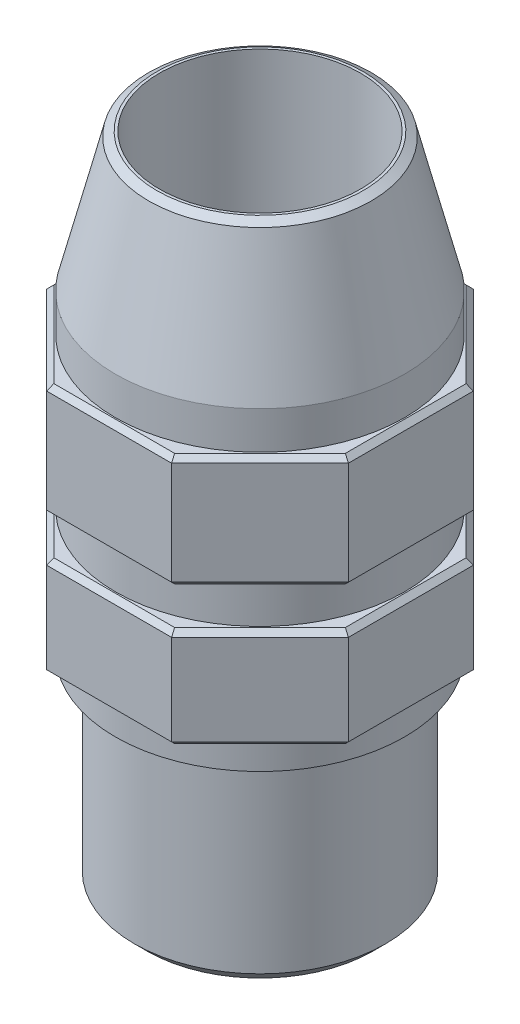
ISO-10303-21;
HEADER;
FILE_DESCRIPTION(('STEP AP214'),'2;1');
FILE_NAME('part.step','',(''),(''),'','','');
FILE_SCHEMA(('AUTOMOTIVE_DESIGN { 1 0 10303 214 1 1 1 1 }'));
ENDSEC;
DATA;
#1=APPLICATION_CONTEXT('core data for automotive mechanical design processes');
#2=APPLICATION_PROTOCOL_DEFINITION('international standard','automotive_design',2000,#1);
#3=PRODUCT_CONTEXT('',#1,'mechanical');
#4=PRODUCT('Part','Part','',(#3));
#5=PRODUCT_RELATED_PRODUCT_CATEGORY('part','',(#4));
#6=PRODUCT_DEFINITION_FORMATION('','',#4);
#7=PRODUCT_DEFINITION_CONTEXT('part definition',#1,'design');
#8=PRODUCT_DEFINITION('design','',#6,#7);
#9=PRODUCT_DEFINITION_SHAPE('','',#8);
#10=(LENGTH_UNIT() NAMED_UNIT(*) SI_UNIT(.MILLI.,.METRE.));
#11=(NAMED_UNIT(*) PLANE_ANGLE_UNIT() SI_UNIT($,.RADIAN.));
#12=(NAMED_UNIT(*) SI_UNIT($,.STERADIAN.) SOLID_ANGLE_UNIT());
#13=UNCERTAINTY_MEASURE_WITH_UNIT(LENGTH_MEASURE(1.E-05),#10,'distance_accuracy_value','');
#14=(GEOMETRIC_REPRESENTATION_CONTEXT(3) GLOBAL_UNCERTAINTY_ASSIGNED_CONTEXT((#13)) GLOBAL_UNIT_ASSIGNED_CONTEXT((#10,
#11,#12)) REPRESENTATION_CONTEXT('',''));
#15=CARTESIAN_POINT('',(0.,0.,0.));
#16=DIRECTION('',(0.,0.,1.));
#17=DIRECTION('',(1.,0.,0.));
#18=AXIS2_PLACEMENT_3D('',#15,#16,#17);
#19=CARTESIAN_POINT('',(2.48528137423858,10.,-6.));
#20=DIRECTION('',(-0.707106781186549,0.,0.707106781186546));
#21=DIRECTION('',(0.707106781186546,0.,0.707106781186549));
#22=AXIS2_PLACEMENT_3D('',#19,#20,#21);
#23=PLANE('',#22);
#24=DIRECTION('',(0.,-1.,0.));
#25=VECTOR('',#24,1.);
#26=CARTESIAN_POINT('',(6.,10.,-2.48528137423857));
#27=LINE('',#26,#25);
#28=CARTESIAN_POINT('',(6.,9.8,-2.48528137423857));
#29=VERTEX_POINT('',#28);
#30=CARTESIAN_POINT('',(6.,5.69999999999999,-2.48528137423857));
#31=VERTEX_POINT('',#30);
#32=EDGE_CURVE('E268',#29,#31,#27,.T.);
#33=ORIENTED_EDGE('',*,*,#32,.T.);
#34=DIRECTION('',(-0.707106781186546,0.,-0.707106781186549));
#35=VECTOR('',#34,1.);
#36=CARTESIAN_POINT('',(2.48528137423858,5.69999999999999,-6.));
#37=LINE('',#36,#35);
#38=CARTESIAN_POINT('',(2.48528137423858,5.69999999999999,-6.));
#39=VERTEX_POINT('',#38);
#40=EDGE_CURVE('E393',#31,#39,#37,.T.);
#41=ORIENTED_EDGE('',*,*,#40,.T.);
#42=DIRECTION('',(0.,-1.,0.));
#43=VECTOR('',#42,1.);
#44=CARTESIAN_POINT('',(2.48528137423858,10.,-6.));
#45=LINE('',#44,#43);
#46=CARTESIAN_POINT('',(2.48528137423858,9.8,-6.));
#47=VERTEX_POINT('',#46);
#48=EDGE_CURVE('E509',#47,#39,#45,.T.);
#49=ORIENTED_EDGE('',*,*,#48,.F.);
#50=DIRECTION('',(0.707106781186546,0.,0.707106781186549));
#51=VECTOR('',#50,1.);
#52=CARTESIAN_POINT('',(6.,9.8,-2.48528137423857));
#53=LINE('',#52,#51);
#54=EDGE_CURVE('E391',#47,#29,#53,.T.);
#55=ORIENTED_EDGE('',*,*,#54,.T.);
#56=EDGE_LOOP('',(#33,#41,#49,#55));
#57=FACE_BOUND('',#56,.T.);
#58=ADVANCED_FACE('F35',(#57),#23,.F.);
#59=CARTESIAN_POINT('',(-2.48528137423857,10.,-6.));
#60=DIRECTION('',(0.,0.,1.));
#61=DIRECTION('',(1.,0.,0.));
#62=AXIS2_PLACEMENT_3D('',#59,#60,#61);
#63=PLANE('',#62);
#64=ORIENTED_EDGE('',*,*,#48,.T.);
#65=DIRECTION('',(-1.,0.,0.));
#66=VECTOR('',#65,1.);
#67=CARTESIAN_POINT('',(-2.48528137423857,5.69999999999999,-6.));
#68=LINE('',#67,#66);
#69=CARTESIAN_POINT('',(-2.48528137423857,5.69999999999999,-6.));
#70=VERTEX_POINT('',#69);
#71=EDGE_CURVE('E389',#39,#70,#68,.T.);
#72=ORIENTED_EDGE('',*,*,#71,.T.);
#73=DIRECTION('',(0.,-1.,0.));
#74=VECTOR('',#73,1.);
#75=CARTESIAN_POINT('',(-2.48528137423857,10.,-6.));
#76=LINE('',#75,#74);
#77=CARTESIAN_POINT('',(-2.48528137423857,9.8,-6.));
#78=VERTEX_POINT('',#77);
#79=EDGE_CURVE('E512',#78,#70,#76,.T.);
#80=ORIENTED_EDGE('',*,*,#79,.F.);
#81=DIRECTION('',(1.,0.,0.));
#82=VECTOR('',#81,1.);
#83=CARTESIAN_POINT('',(2.48528137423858,9.8,-6.));
#84=LINE('',#83,#82);
#85=EDGE_CURVE('E387',#78,#47,#84,.T.);
#86=ORIENTED_EDGE('',*,*,#85,.T.);
#87=EDGE_LOOP('',(#64,#72,#80,#86));
#88=FACE_BOUND('',#87,.T.);
#89=ADVANCED_FACE('F508',(#88),#63,.F.);
#90=CARTESIAN_POINT('',(-2.48528137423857,10.,-6.));
#91=DIRECTION('',(0.707106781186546,0.,0.707106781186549));
#92=DIRECTION('',(0.707106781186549,0.,-0.707106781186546));
#93=AXIS2_PLACEMENT_3D('',#90,#91,#92);
#94=PLANE('',#93);
#95=ORIENTED_EDGE('',*,*,#79,.T.);
#96=DIRECTION('',(-0.707106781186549,0.,0.707106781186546));
#97=VECTOR('',#96,1.);
#98=CARTESIAN_POINT('',(-6.,5.69999999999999,-2.48528137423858));
#99=LINE('',#98,#97);
#100=CARTESIAN_POINT('',(-6.,5.69999999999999,-2.48528137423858));
#101=VERTEX_POINT('',#100);
#102=EDGE_CURVE('E385',#70,#101,#99,.T.);
#103=ORIENTED_EDGE('',*,*,#102,.T.);
#104=DIRECTION('',(0.,-1.,0.));
#105=VECTOR('',#104,1.);
#106=CARTESIAN_POINT('',(-6.,10.,-2.48528137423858));
#107=LINE('',#106,#105);
#108=CARTESIAN_POINT('',(-6.,9.8,-2.48528137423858));
#109=VERTEX_POINT('',#108);
#110=EDGE_CURVE('E656',#109,#101,#107,.T.);
#111=ORIENTED_EDGE('',*,*,#110,.F.);
#112=DIRECTION('',(0.707106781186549,0.,-0.707106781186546));
#113=VECTOR('',#112,1.);
#114=CARTESIAN_POINT('',(-2.48528137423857,9.8,-6.));
#115=LINE('',#114,#113);
#116=EDGE_CURVE('E383',#109,#78,#115,.T.);
#117=ORIENTED_EDGE('',*,*,#116,.T.);
#118=EDGE_LOOP('',(#95,#103,#111,#117));
#119=FACE_BOUND('',#118,.T.);
#120=ADVANCED_FACE('F566',(#119),#94,.F.);
#121=CARTESIAN_POINT('',(-6.,10.,-2.48528137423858));
#122=DIRECTION('',(1.,0.,0.));
#123=DIRECTION('',(0.,0.,-1.));
#124=AXIS2_PLACEMENT_3D('',#121,#122,#123);
#125=PLANE('',#124);
#126=ORIENTED_EDGE('',*,*,#110,.T.);
#127=DIRECTION('',(0.,0.,1.));
#128=VECTOR('',#127,1.);
#129=CARTESIAN_POINT('',(-6.,5.69999999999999,2.48528137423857));
#130=LINE('',#129,#128);
#131=CARTESIAN_POINT('',(-6.,5.69999999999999,2.48528137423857));
#132=VERTEX_POINT('',#131);
#133=EDGE_CURVE('E381',#101,#132,#130,.T.);
#134=ORIENTED_EDGE('',*,*,#133,.T.);
#135=DIRECTION('',(0.,-1.,0.));
#136=VECTOR('',#135,1.);
#137=CARTESIAN_POINT('',(-6.,10.,2.48528137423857));
#138=LINE('',#137,#136);
#139=CARTESIAN_POINT('',(-6.,9.8,2.48528137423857));
#140=VERTEX_POINT('',#139);
#141=EDGE_CURVE('E654',#140,#132,#138,.T.);
#142=ORIENTED_EDGE('',*,*,#141,.F.);
#143=DIRECTION('',(0.,0.,-1.));
#144=VECTOR('',#143,1.);
#145=CARTESIAN_POINT('',(-6.,9.8,-2.48528137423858));
#146=LINE('',#145,#144);
#147=EDGE_CURVE('E379',#140,#109,#146,.T.);
#148=ORIENTED_EDGE('',*,*,#147,.T.);
#149=EDGE_LOOP('',(#126,#134,#142,#148));
#150=FACE_BOUND('',#149,.T.);
#151=ADVANCED_FACE('F616',(#150),#125,.F.);
#152=CARTESIAN_POINT('',(-6.,10.,2.48528137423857));
#153=DIRECTION('',(0.707106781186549,0.,-0.707106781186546));
#154=DIRECTION('',(-0.707106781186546,0.,-0.707106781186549));
#155=AXIS2_PLACEMENT_3D('',#152,#153,#154);
#156=PLANE('',#155);
#157=ORIENTED_EDGE('',*,*,#141,.T.);
#158=DIRECTION('',(0.707106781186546,0.,0.707106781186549));
#159=VECTOR('',#158,1.);
#160=CARTESIAN_POINT('',(-2.48528137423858,5.69999999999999,6.));
#161=LINE('',#160,#159);
#162=CARTESIAN_POINT('',(-2.48528137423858,5.69999999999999,6.));
#163=VERTEX_POINT('',#162);
#164=EDGE_CURVE('E377',#132,#163,#161,.T.);
#165=ORIENTED_EDGE('',*,*,#164,.T.);
#166=DIRECTION('',(0.,-1.,0.));
#167=VECTOR('',#166,1.);
#168=CARTESIAN_POINT('',(-2.48528137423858,10.,6.));
#169=LINE('',#168,#167);
#170=CARTESIAN_POINT('',(-2.48528137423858,9.8,6.));
#171=VERTEX_POINT('',#170);
#172=EDGE_CURVE('E666',#171,#163,#169,.T.);
#173=ORIENTED_EDGE('',*,*,#172,.F.);
#174=DIRECTION('',(-0.707106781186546,0.,-0.707106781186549));
#175=VECTOR('',#174,1.);
#176=CARTESIAN_POINT('',(-6.,9.8,2.48528137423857));
#177=LINE('',#176,#175);
#178=EDGE_CURVE('E375',#171,#140,#177,.T.);
#179=ORIENTED_EDGE('',*,*,#178,.T.);
#180=EDGE_LOOP('',(#157,#165,#173,#179));
#181=FACE_BOUND('',#180,.T.);
#182=ADVANCED_FACE('F612',(#181),#156,.F.);
#183=CARTESIAN_POINT('',(-2.48528137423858,10.,6.));
#184=DIRECTION('',(0.,0.,-1.));
#185=DIRECTION('',(-1.,0.,0.));
#186=AXIS2_PLACEMENT_3D('',#183,#184,#185);
#187=PLANE('',#186);
#188=ORIENTED_EDGE('',*,*,#172,.T.);
#189=DIRECTION('',(1.,0.,0.));
#190=VECTOR('',#189,1.);
#191=CARTESIAN_POINT('',(2.48528137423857,5.69999999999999,6.));
#192=LINE('',#191,#190);
#193=CARTESIAN_POINT('',(2.48528137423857,5.69999999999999,6.));
#194=VERTEX_POINT('',#193);
#195=EDGE_CURVE('E373',#163,#194,#192,.T.);
#196=ORIENTED_EDGE('',*,*,#195,.T.);
#197=DIRECTION('',(0.,-1.,0.));
#198=VECTOR('',#197,1.);
#199=CARTESIAN_POINT('',(2.48528137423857,10.,6.));
#200=LINE('',#199,#198);
#201=CARTESIAN_POINT('',(2.48528137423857,9.8,6.));
#202=VERTEX_POINT('',#201);
#203=EDGE_CURVE('E730',#202,#194,#200,.T.);
#204=ORIENTED_EDGE('',*,*,#203,.F.);
#205=DIRECTION('',(-1.,0.,0.));
#206=VECTOR('',#205,1.);
#207=CARTESIAN_POINT('',(-2.48528137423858,9.8,6.));
#208=LINE('',#207,#206);
#209=EDGE_CURVE('E370',#202,#171,#208,.T.);
#210=ORIENTED_EDGE('',*,*,#209,.T.);
#211=EDGE_LOOP('',(#188,#196,#204,#210));
#212=FACE_BOUND('',#211,.T.);
#213=ADVANCED_FACE('F584',(#212),#187,.F.);
#214=CARTESIAN_POINT('',(2.48528137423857,10.,6.));
#215=DIRECTION('',(-0.707106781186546,0.,-0.707106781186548));
#216=DIRECTION('',(-0.707106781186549,0.,0.707106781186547));
#217=AXIS2_PLACEMENT_3D('',#214,#215,#216);
#218=PLANE('',#217);
#219=ORIENTED_EDGE('',*,*,#203,.T.);
#220=DIRECTION('',(0.707106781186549,0.,-0.707106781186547));
#221=VECTOR('',#220,1.);
#222=CARTESIAN_POINT('',(6.,5.69999999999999,2.48528137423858));
#223=LINE('',#222,#221);
#224=CARTESIAN_POINT('',(6.,5.69999999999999,2.48528137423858));
#225=VERTEX_POINT('',#224);
#226=EDGE_CURVE('E367',#194,#225,#223,.T.);
#227=ORIENTED_EDGE('',*,*,#226,.T.);
#228=DIRECTION('',(0.,-1.,0.));
#229=VECTOR('',#228,1.);
#230=CARTESIAN_POINT('',(6.,10.,2.48528137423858));
#231=LINE('',#230,#229);
#232=CARTESIAN_POINT('',(6.,9.8,2.48528137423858));
#233=VERTEX_POINT('',#232);
#234=EDGE_CURVE('E731',#233,#225,#231,.T.);
#235=ORIENTED_EDGE('',*,*,#234,.F.);
#236=DIRECTION('',(-0.707106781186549,0.,0.707106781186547));
#237=VECTOR('',#236,1.);
#238=CARTESIAN_POINT('',(2.48528137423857,9.8,6.));
#239=LINE('',#238,#237);
#240=EDGE_CURVE('E365',#233,#202,#239,.T.);
#241=ORIENTED_EDGE('',*,*,#240,.T.);
#242=EDGE_LOOP('',(#219,#227,#235,#241));
#243=FACE_BOUND('',#242,.T.);
#244=ADVANCED_FACE('F578',(#243),#218,.F.);
#245=CARTESIAN_POINT('',(6.,10.,-2.48528137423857));
#246=DIRECTION('',(-1.,0.,0.));
#247=DIRECTION('',(0.,0.,1.));
#248=AXIS2_PLACEMENT_3D('',#245,#246,#247);
#249=PLANE('',#248);
#250=ORIENTED_EDGE('',*,*,#234,.T.);
#251=DIRECTION('',(0.,0.,-1.));
#252=VECTOR('',#251,1.);
#253=CARTESIAN_POINT('',(6.,5.69999999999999,-2.48528137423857));
#254=LINE('',#253,#252);
#255=EDGE_CURVE('E397',#225,#31,#254,.T.);
#256=ORIENTED_EDGE('',*,*,#255,.T.);
#257=ORIENTED_EDGE('',*,*,#32,.F.);
#258=DIRECTION('',(0.,0.,1.));
#259=VECTOR('',#258,1.);
#260=CARTESIAN_POINT('',(6.,9.8,2.48528137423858));
#261=LINE('',#260,#259);
#262=EDGE_CURVE('E395',#29,#233,#261,.T.);
#263=ORIENTED_EDGE('',*,*,#262,.T.);
#264=EDGE_LOOP('',(#250,#256,#257,#263));
#265=FACE_BOUND('',#264,.T.);
#266=ADVANCED_FACE('F571',(#265),#249,.F.);
#267=CARTESIAN_POINT('',(6.,3.8,-2.48528137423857));
#268=VERTEX_POINT('',#267);
#269=CARTESIAN_POINT('',(6.,0.199999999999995,-2.48528137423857));
#270=VERTEX_POINT('',#269);
#271=EDGE_CURVE('E248',#268,#270,#27,.T.);
#272=ORIENTED_EDGE('',*,*,#271,.T.);
#273=DIRECTION('',(-0.707106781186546,0.,-0.707106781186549));
#274=VECTOR('',#273,1.);
#275=CARTESIAN_POINT('',(2.48528137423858,0.199999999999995,-6.));
#276=LINE('',#275,#274);
#277=CARTESIAN_POINT('',(2.48528137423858,0.199999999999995,-6.));
#278=VERTEX_POINT('',#277);
#279=EDGE_CURVE('E255',#270,#278,#276,.T.);
#280=ORIENTED_EDGE('',*,*,#279,.T.);
#281=CARTESIAN_POINT('',(2.48528137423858,3.8,-6.));
#282=VERTEX_POINT('',#281);
#283=EDGE_CURVE('E250',#282,#278,#45,.T.);
#284=ORIENTED_EDGE('',*,*,#283,.F.);
#285=DIRECTION('',(0.707106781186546,0.,0.707106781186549));
#286=VECTOR('',#285,1.);
#287=CARTESIAN_POINT('',(2.48528137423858,3.8,-6.));
#288=LINE('',#287,#286);
#289=EDGE_CURVE('E245',#282,#268,#288,.T.);
#290=ORIENTED_EDGE('',*,*,#289,.T.);
#291=EDGE_LOOP('',(#272,#280,#284,#290));
#292=FACE_BOUND('',#291,.T.);
#293=ADVANCED_FACE('F247',(#292),#23,.F.);
#294=ORIENTED_EDGE('',*,*,#283,.T.);
#295=DIRECTION('',(-1.,0.,0.));
#296=VECTOR('',#295,1.);
#297=CARTESIAN_POINT('',(-2.48528137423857,0.199999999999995,-6.));
#298=LINE('',#297,#296);
#299=CARTESIAN_POINT('',(-2.48528137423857,0.199999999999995,-6.));
#300=VERTEX_POINT('',#299);
#301=EDGE_CURVE('E323',#278,#300,#298,.T.);
#302=ORIENTED_EDGE('',*,*,#301,.T.);
#303=CARTESIAN_POINT('',(-2.48528137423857,3.8,-6.));
#304=VERTEX_POINT('',#303);
#305=EDGE_CURVE('E631',#304,#300,#76,.T.);
#306=ORIENTED_EDGE('',*,*,#305,.F.);
#307=DIRECTION('',(1.,0.,0.));
#308=VECTOR('',#307,1.);
#309=CARTESIAN_POINT('',(-2.48528137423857,3.8,-6.));
#310=LINE('',#309,#308);
#311=EDGE_CURVE('E321',#304,#282,#310,.T.);
#312=ORIENTED_EDGE('',*,*,#311,.T.);
#313=EDGE_LOOP('',(#294,#302,#306,#312));
#314=FACE_BOUND('',#313,.T.);
#315=ADVANCED_FACE('F568',(#314),#63,.F.);
#316=ORIENTED_EDGE('',*,*,#305,.T.);
#317=DIRECTION('',(-0.707106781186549,0.,0.707106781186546));
#318=VECTOR('',#317,1.);
#319=CARTESIAN_POINT('',(-2.48528137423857,0.199999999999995,-6.));
#320=LINE('',#319,#318);
#321=CARTESIAN_POINT('',(-6.,0.199999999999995,-2.48528137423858));
#322=VERTEX_POINT('',#321);
#323=EDGE_CURVE('E327',#300,#322,#320,.T.);
#324=ORIENTED_EDGE('',*,*,#323,.T.);
#325=CARTESIAN_POINT('',(-6.,3.8,-2.48528137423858));
#326=VERTEX_POINT('',#325);
#327=EDGE_CURVE('E661',#326,#322,#107,.T.);
#328=ORIENTED_EDGE('',*,*,#327,.F.);
#329=DIRECTION('',(0.707106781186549,0.,-0.707106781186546));
#330=VECTOR('',#329,1.);
#331=CARTESIAN_POINT('',(-2.48528137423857,3.8,-6.));
#332=LINE('',#331,#330);
#333=EDGE_CURVE('E325',#326,#304,#332,.T.);
#334=ORIENTED_EDGE('',*,*,#333,.T.);
#335=EDGE_LOOP('',(#316,#324,#328,#334));
#336=FACE_BOUND('',#335,.T.);
#337=ADVANCED_FACE('F576',(#336),#94,.F.);
#338=ORIENTED_EDGE('',*,*,#327,.T.);
#339=DIRECTION('',(0.,0.,1.));
#340=VECTOR('',#339,1.);
#341=CARTESIAN_POINT('',(-6.,0.199999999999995,-2.48528137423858));
#342=LINE('',#341,#340);
#343=CARTESIAN_POINT('',(-6.,0.199999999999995,2.48528137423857));
#344=VERTEX_POINT('',#343);
#345=EDGE_CURVE('E331',#322,#344,#342,.T.);
#346=ORIENTED_EDGE('',*,*,#345,.T.);
#347=CARTESIAN_POINT('',(-6.,3.8,2.48528137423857));
#348=VERTEX_POINT('',#347);
#349=EDGE_CURVE('E662',#348,#344,#138,.T.);
#350=ORIENTED_EDGE('',*,*,#349,.F.);
#351=DIRECTION('',(0.,0.,-1.));
#352=VECTOR('',#351,1.);
#353=CARTESIAN_POINT('',(-6.,3.8,-2.48528137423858));
#354=LINE('',#353,#352);
#355=EDGE_CURVE('E329',#348,#326,#354,.T.);
#356=ORIENTED_EDGE('',*,*,#355,.T.);
#357=EDGE_LOOP('',(#338,#346,#350,#356));
#358=FACE_BOUND('',#357,.T.);
#359=ADVANCED_FACE('F610',(#358),#125,.F.);
#360=ORIENTED_EDGE('',*,*,#349,.T.);
#361=DIRECTION('',(0.707106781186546,0.,0.707106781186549));
#362=VECTOR('',#361,1.);
#363=CARTESIAN_POINT('',(-6.,0.199999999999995,2.48528137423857));
#364=LINE('',#363,#362);
#365=CARTESIAN_POINT('',(-2.48528137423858,0.199999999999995,6.));
#366=VERTEX_POINT('',#365);
#367=EDGE_CURVE('E256',#344,#366,#364,.T.);
#368=ORIENTED_EDGE('',*,*,#367,.T.);
#369=CARTESIAN_POINT('',(-2.48528137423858,3.8,6.));
#370=VERTEX_POINT('',#369);
#371=EDGE_CURVE('E698',#370,#366,#169,.T.);
#372=ORIENTED_EDGE('',*,*,#371,.F.);
#373=DIRECTION('',(-0.707106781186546,0.,-0.707106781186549));
#374=VECTOR('',#373,1.);
#375=CARTESIAN_POINT('',(-6.,3.8,2.48528137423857));
#376=LINE('',#375,#374);
#377=EDGE_CURVE('E317',#370,#348,#376,.T.);
#378=ORIENTED_EDGE('',*,*,#377,.T.);
#379=EDGE_LOOP('',(#360,#368,#372,#378));
#380=FACE_BOUND('',#379,.T.);
#381=ADVANCED_FACE('F603',(#380),#156,.F.);
#382=ORIENTED_EDGE('',*,*,#371,.T.);
#383=DIRECTION('',(1.,0.,0.));
#384=VECTOR('',#383,1.);
#385=CARTESIAN_POINT('',(-2.48528137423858,0.199999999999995,6.));
#386=LINE('',#385,#384);
#387=CARTESIAN_POINT('',(2.48528137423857,0.199999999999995,6.));
#388=VERTEX_POINT('',#387);
#389=EDGE_CURVE('E315',#366,#388,#386,.T.);
#390=ORIENTED_EDGE('',*,*,#389,.T.);
#391=CARTESIAN_POINT('',(2.48528137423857,3.8,6.));
#392=VERTEX_POINT('',#391);
#393=EDGE_CURVE('E726',#392,#388,#200,.T.);
#394=ORIENTED_EDGE('',*,*,#393,.F.);
#395=DIRECTION('',(-1.,0.,0.));
#396=VECTOR('',#395,1.);
#397=CARTESIAN_POINT('',(-2.48528137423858,3.8,6.));
#398=LINE('',#397,#396);
#399=EDGE_CURVE('E313',#392,#370,#398,.T.);
#400=ORIENTED_EDGE('',*,*,#399,.T.);
#401=EDGE_LOOP('',(#382,#390,#394,#400));
#402=FACE_BOUND('',#401,.T.);
#403=ADVANCED_FACE('F598',(#402),#187,.F.);
#404=ORIENTED_EDGE('',*,*,#393,.T.);
#405=DIRECTION('',(0.707106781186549,0.,-0.707106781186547));
#406=VECTOR('',#405,1.);
#407=CARTESIAN_POINT('',(2.48528137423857,0.199999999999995,6.));
#408=LINE('',#407,#406);
#409=CARTESIAN_POINT('',(6.,0.199999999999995,2.48528137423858));
#410=VERTEX_POINT('',#409);
#411=EDGE_CURVE('E311',#388,#410,#408,.T.);
#412=ORIENTED_EDGE('',*,*,#411,.T.);
#413=CARTESIAN_POINT('',(6.,3.8,2.48528137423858));
#414=VERTEX_POINT('',#413);
#415=EDGE_CURVE('E728',#414,#410,#231,.T.);
#416=ORIENTED_EDGE('',*,*,#415,.F.);
#417=DIRECTION('',(-0.707106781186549,0.,0.707106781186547));
#418=VECTOR('',#417,1.);
#419=CARTESIAN_POINT('',(2.48528137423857,3.8,6.));
#420=LINE('',#419,#418);
#421=EDGE_CURVE('E309',#414,#392,#420,.T.);
#422=ORIENTED_EDGE('',*,*,#421,.T.);
#423=EDGE_LOOP('',(#404,#412,#416,#422));
#424=FACE_BOUND('',#423,.T.);
#425=ADVANCED_FACE('F587',(#424),#218,.F.);
#426=ORIENTED_EDGE('',*,*,#415,.T.);
#427=DIRECTION('',(0.,0.,-1.));
#428=VECTOR('',#427,1.);
#429=CARTESIAN_POINT('',(6.,0.199999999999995,-2.48528137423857));
#430=LINE('',#429,#428);
#431=EDGE_CURVE('E267',#410,#270,#430,.T.);
#432=ORIENTED_EDGE('',*,*,#431,.T.);
#433=ORIENTED_EDGE('',*,*,#271,.F.);
#434=DIRECTION('',(0.,0.,1.));
#435=VECTOR('',#434,1.);
#436=CARTESIAN_POINT('',(6.,3.8,-2.48528137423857));
#437=LINE('',#436,#435);
#438=EDGE_CURVE('E264',#268,#414,#437,.T.);
#439=ORIENTED_EDGE('',*,*,#438,.T.);
#440=EDGE_LOOP('',(#426,#432,#433,#439));
#441=FACE_BOUND('',#440,.T.);
#442=ADVANCED_FACE('F262',(#441),#249,.F.);
#443=CARTESIAN_POINT('',(0.,10.,0.));
#444=DIRECTION('',(0.,1.,0.));
#445=DIRECTION('',(0.,0.,1.));
#446=AXIS2_PLACEMENT_3D('',#443,#444,#445);
#447=PLANE('',#446);
#448=DIRECTION('',(0.707106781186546,0.,0.707106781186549));
#449=VECTOR('',#448,1.);
#450=CARTESIAN_POINT('',(-2.34386001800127,10.,5.85857864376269));
#451=LINE('',#450,#449);
#452=CARTESIAN_POINT('',(-5.80000000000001,10.,2.40243866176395));
#453=VERTEX_POINT('',#452);
#454=CARTESIAN_POINT('',(-2.40243866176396,10.,5.80000000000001));
#455=VERTEX_POINT('',#454);
#456=EDGE_CURVE('E44',#453,#455,#451,.T.);
#457=ORIENTED_EDGE('',*,*,#456,.T.);
#458=DIRECTION('',(1.,0.,0.));
#459=VECTOR('',#458,1.);
#460=CARTESIAN_POINT('',(2.48528137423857,10.,5.80000000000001));
#461=LINE('',#460,#459);
#462=CARTESIAN_POINT('',(2.40243866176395,10.,5.80000000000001));
#463=VERTEX_POINT('',#462);
#464=EDGE_CURVE('E12',#455,#463,#461,.T.);
#465=ORIENTED_EDGE('',*,*,#464,.T.);
#466=DIRECTION('',(0.707106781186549,0.,-0.707106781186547));
#467=VECTOR('',#466,1.);
#468=CARTESIAN_POINT('',(5.85857864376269,10.,2.34386001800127));
#469=LINE('',#468,#467);
#470=CARTESIAN_POINT('',(5.80000000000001,10.,2.40243866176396));
#471=VERTEX_POINT('',#470);
#472=EDGE_CURVE('E401',#463,#471,#469,.T.);
#473=ORIENTED_EDGE('',*,*,#472,.T.);
#474=DIRECTION('',(0.,0.,-1.));
#475=VECTOR('',#474,1.);
#476=CARTESIAN_POINT('',(5.80000000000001,10.,-2.48528137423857));
#477=LINE('',#476,#475);
#478=CARTESIAN_POINT('',(5.80000000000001,10.,-2.40243866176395));
#479=VERTEX_POINT('',#478);
#480=EDGE_CURVE('E399',#471,#479,#477,.T.);
#481=ORIENTED_EDGE('',*,*,#480,.T.);
#482=DIRECTION('',(-0.707106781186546,0.,-0.707106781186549));
#483=VECTOR('',#482,1.);
#484=CARTESIAN_POINT('',(2.34386001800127,10.,-5.85857864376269));
#485=LINE('',#484,#483);
#486=CARTESIAN_POINT('',(2.40243866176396,10.,-5.80000000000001));
#487=VERTEX_POINT('',#486);
#488=EDGE_CURVE('E403',#479,#487,#485,.T.);
#489=ORIENTED_EDGE('',*,*,#488,.T.);
#490=DIRECTION('',(-1.,0.,0.));
#491=VECTOR('',#490,1.);
#492=CARTESIAN_POINT('',(-2.48528137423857,10.,-5.80000000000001));
#493=LINE('',#492,#491);
#494=CARTESIAN_POINT('',(-2.40243866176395,10.,-5.80000000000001));
#495=VERTEX_POINT('',#494);
#496=EDGE_CURVE('E405',#487,#495,#493,.T.);
#497=ORIENTED_EDGE('',*,*,#496,.T.);
#498=DIRECTION('',(-0.707106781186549,0.,0.707106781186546));
#499=VECTOR('',#498,1.);
#500=CARTESIAN_POINT('',(-5.85857864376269,10.,-2.34386001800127));
#501=LINE('',#500,#499);
#502=CARTESIAN_POINT('',(-5.80000000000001,10.,-2.40243866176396));
#503=VERTEX_POINT('',#502);
#504=EDGE_CURVE('E407',#495,#503,#501,.T.);
#505=ORIENTED_EDGE('',*,*,#504,.T.);
#506=DIRECTION('',(0.,0.,1.));
#507=VECTOR('',#506,1.);
#508=CARTESIAN_POINT('',(-5.80000000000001,10.,2.48528137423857));
#509=LINE('',#508,#507);
#510=EDGE_CURVE('E55',#503,#453,#509,.T.);
#511=ORIENTED_EDGE('',*,*,#510,.T.);
#512=EDGE_LOOP('',(#457,#465,#473,#481,#489,#497,#505,#511));
#513=FACE_BOUND('',#512,.T.);
#514=CARTESIAN_POINT('',(0.,10.,0.));
#515=DIRECTION('',(0.,1.,0.));
#516=DIRECTION('',(0.,0.,1.));
#517=AXIS2_PLACEMENT_3D('',#514,#515,#516);
#518=CIRCLE('',#517,5.75);
#519=CARTESIAN_POINT('',(0.,10.,5.75));
#520=VERTEX_POINT('',#519);
#521=EDGE_CURVE('E517',#520,#520,#518,.T.);
#522=ORIENTED_EDGE('',*,*,#521,.F.);
#523=EDGE_LOOP('',(#522));
#524=FACE_BOUND('',#523,.T.);
#525=ADVANCED_FACE('F591',(#513,#524),#447,.T.);
#526=CARTESIAN_POINT('',(0.,0.,0.));
#527=DIRECTION('',(0.,1.,0.));
#528=DIRECTION('',(0.,0.,1.));
#529=AXIS2_PLACEMENT_3D('',#526,#527,#528);
#530=PLANE('',#529);
#531=DIRECTION('',(0.707106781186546,0.,0.707106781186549));
#532=VECTOR('',#531,1.);
#533=CARTESIAN_POINT('',(4.10121933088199,0.,-4.10121933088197));
#534=LINE('',#533,#532);
#535=CARTESIAN_POINT('',(2.40243866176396,0.,-5.80000000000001));
#536=VERTEX_POINT('',#535);
#537=CARTESIAN_POINT('',(5.80000000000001,0.,-2.40243866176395));
#538=VERTEX_POINT('',#537);
#539=EDGE_CURVE('E298',#536,#538,#534,.T.);
#540=ORIENTED_EDGE('',*,*,#539,.T.);
#541=DIRECTION('',(0.,0.,1.));
#542=VECTOR('',#541,1.);
#543=CARTESIAN_POINT('',(5.80000000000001,0.,0.));
#544=LINE('',#543,#542);
#545=CARTESIAN_POINT('',(5.80000000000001,0.,2.40243866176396));
#546=VERTEX_POINT('',#545);
#547=EDGE_CURVE('E306',#538,#546,#544,.T.);
#548=ORIENTED_EDGE('',*,*,#547,.T.);
#549=DIRECTION('',(-0.707106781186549,0.,0.707106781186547));
#550=VECTOR('',#549,1.);
#551=CARTESIAN_POINT('',(4.10121933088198,0.,4.10121933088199));
#552=LINE('',#551,#550);
#553=CARTESIAN_POINT('',(2.40243866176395,0.,5.80000000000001));
#554=VERTEX_POINT('',#553);
#555=EDGE_CURVE('E304',#546,#554,#552,.T.);
#556=ORIENTED_EDGE('',*,*,#555,.T.);
#557=DIRECTION('',(-1.,0.,0.));
#558=VECTOR('',#557,1.);
#559=CARTESIAN_POINT('',(0.,0.,5.80000000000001));
#560=LINE('',#559,#558);
#561=CARTESIAN_POINT('',(-2.40243866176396,0.,5.80000000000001));
#562=VERTEX_POINT('',#561);
#563=EDGE_CURVE('E302',#554,#562,#560,.T.);
#564=ORIENTED_EDGE('',*,*,#563,.T.);
#565=DIRECTION('',(-0.707106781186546,0.,-0.707106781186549));
#566=VECTOR('',#565,1.);
#567=CARTESIAN_POINT('',(-4.10121933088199,0.,4.10121933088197));
#568=LINE('',#567,#566);
#569=CARTESIAN_POINT('',(-5.80000000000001,0.,2.40243866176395));
#570=VERTEX_POINT('',#569);
#571=EDGE_CURVE('E300',#562,#570,#568,.T.);
#572=ORIENTED_EDGE('',*,*,#571,.T.);
#573=DIRECTION('',(0.,0.,-1.));
#574=VECTOR('',#573,1.);
#575=CARTESIAN_POINT('',(-5.80000000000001,0.,0.));
#576=LINE('',#575,#574);
#577=CARTESIAN_POINT('',(-5.80000000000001,0.,-2.40243866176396));
#578=VERTEX_POINT('',#577);
#579=EDGE_CURVE('E286',#570,#578,#576,.T.);
#580=ORIENTED_EDGE('',*,*,#579,.T.);
#581=DIRECTION('',(0.707106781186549,0.,-0.707106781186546));
#582=VECTOR('',#581,1.);
#583=CARTESIAN_POINT('',(-4.10121933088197,0.,-4.10121933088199));
#584=LINE('',#583,#582);
#585=CARTESIAN_POINT('',(-2.40243866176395,0.,-5.80000000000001));
#586=VERTEX_POINT('',#585);
#587=EDGE_CURVE('E294',#578,#586,#584,.T.);
#588=ORIENTED_EDGE('',*,*,#587,.T.);
#589=DIRECTION('',(1.,0.,0.));
#590=VECTOR('',#589,1.);
#591=CARTESIAN_POINT('',(0.,0.,-5.80000000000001));
#592=LINE('',#591,#590);
#593=EDGE_CURVE('E296',#586,#536,#592,.T.);
#594=ORIENTED_EDGE('',*,*,#593,.T.);
#595=EDGE_LOOP('',(#540,#548,#556,#564,#572,#580,#588,#594));
#596=FACE_BOUND('',#595,.T.);
#597=CARTESIAN_POINT('',(0.,0.,0.));
#598=DIRECTION('',(0.,-1.,0.));
#599=DIRECTION('',(0.,0.,-1.));
#600=AXIS2_PLACEMENT_3D('',#597,#598,#599);
#601=CIRCLE('',#600,5.75);
#602=CARTESIAN_POINT('',(0.,0.,-5.75));
#603=VERTEX_POINT('',#602);
#604=EDGE_CURVE('E520',#603,#603,#601,.T.);
#605=ORIENTED_EDGE('',*,*,#604,.F.);
#606=EDGE_LOOP('',(#605));
#607=FACE_BOUND('',#606,.T.);
#608=ADVANCED_FACE('F596',(#596,#607),#530,.F.);
#609=CARTESIAN_POINT('',(0.,11.5,0.));
#610=DIRECTION('',(0.,-1.,0.));
#611=DIRECTION('',(0.,0.,-1.));
#612=AXIS2_PLACEMENT_3D('',#609,#610,#611);
#613=CYLINDRICAL_SURFACE('',#612,5.75);
#614=CARTESIAN_POINT('',(0.,11.5,0.));
#615=DIRECTION('',(0.,1.,0.));
#616=DIRECTION('',(0.,0.,1.));
#617=AXIS2_PLACEMENT_3D('',#614,#615,#616);
#618=CIRCLE('',#617,5.75);
#619=CARTESIAN_POINT('',(0.,11.5,5.75));
#620=VERTEX_POINT('',#619);
#621=EDGE_CURVE('E269',#620,#620,#618,.T.);
#622=ORIENTED_EDGE('',*,*,#621,.F.);
#623=EDGE_LOOP('',(#622));
#624=FACE_BOUND('',#623,.T.);
#625=ORIENTED_EDGE('',*,*,#521,.T.);
#626=EDGE_LOOP('',(#625));
#627=FACE_BOUND('',#626,.T.);
#628=ADVANCED_FACE('F783',(#624,#627),#613,.T.);
#629=CARTESIAN_POINT('',(0.,11.5,0.));
#630=DIRECTION('',(0.,-1.,0.));
#631=DIRECTION('',(0.,0.,1.));
#632=AXIS2_PLACEMENT_3D('',#629,#630,#631);
#633=CONICAL_SURFACE('',#632,5.75,0.244346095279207);
#634=CARTESIAN_POINT('',(0.,16.8059408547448,0.));
#635=DIRECTION('',(0.,-1.,0.));
#636=DIRECTION('',(0.,0.,-1.));
#637=AXIS2_PLACEMENT_3D('',#634,#635,#636);
#638=CIRCLE('',#637,4.42708036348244);
#639=CARTESIAN_POINT('',(0.,16.8059408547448,-4.42708036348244));
#640=VERTEX_POINT('',#639);
#641=EDGE_CURVE('E284',#640,#640,#638,.T.);
#642=ORIENTED_EDGE('',*,*,#641,.T.);
#643=EDGE_LOOP('',(#642));
#644=FACE_BOUND('',#643,.T.);
#645=ORIENTED_EDGE('',*,*,#621,.T.);
#646=EDGE_LOOP('',(#645));
#647=FACE_BOUND('',#646,.T.);
#648=ADVANCED_FACE('F780',(#644,#647),#633,.T.);
#649=CARTESIAN_POINT('',(0.,17.,0.));
#650=DIRECTION('',(0.,1.,0.));
#651=DIRECTION('',(0.,0.,1.));
#652=AXIS2_PLACEMENT_3D('',#649,#650,#651);
#653=PLANE('',#652);
#654=CARTESIAN_POINT('',(0.,17.,0.));
#655=DIRECTION('',(0.,1.,0.));
#656=DIRECTION('',(0.,0.,1.));
#657=AXIS2_PLACEMENT_3D('',#654,#655,#656);
#658=CIRCLE('',#657,4.10411170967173);
#659=CARTESIAN_POINT('',(0.,17.,4.10411170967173));
#660=VERTEX_POINT('',#659);
#661=EDGE_CURVE('E289',#660,#660,#658,.T.);
#662=ORIENTED_EDGE('',*,*,#661,.T.);
#663=EDGE_LOOP('',(#662));
#664=FACE_BOUND('',#663,.T.);
#665=CARTESIAN_POINT('',(0.,17.,0.));
#666=DIRECTION('',(0.,-1.,0.));
#667=DIRECTION('',(0.,0.,-1.));
#668=AXIS2_PLACEMENT_3D('',#665,#666,#667);
#669=CIRCLE('',#668,4.);
#670=CARTESIAN_POINT('',(0.,17.,-4.));
#671=VERTEX_POINT('',#670);
#672=EDGE_CURVE('E534',#671,#671,#669,.T.);
#673=ORIENTED_EDGE('',*,*,#672,.T.);
#674=EDGE_LOOP('',(#673));
#675=FACE_BOUND('',#674,.T.);
#676=ADVANCED_FACE('F539',(#664,#675),#653,.T.);
#677=CARTESIAN_POINT('',(0.,-1.,0.));
#678=DIRECTION('',(0.,1.,0.));
#679=DIRECTION('',(0.,0.,1.));
#680=AXIS2_PLACEMENT_3D('',#677,#678,#679);
#681=CYLINDRICAL_SURFACE('',#680,5.75);
#682=CARTESIAN_POINT('',(0.,-1.,0.));
#683=DIRECTION('',(0.,-1.,0.));
#684=DIRECTION('',(0.,0.,-1.));
#685=AXIS2_PLACEMENT_3D('',#682,#683,#684);
#686=CIRCLE('',#685,5.75);
#687=CARTESIAN_POINT('',(0.,-1.,-5.75));
#688=VERTEX_POINT('',#687);
#689=EDGE_CURVE('E737',#688,#688,#686,.T.);
#690=ORIENTED_EDGE('',*,*,#689,.F.);
#691=EDGE_LOOP('',(#690));
#692=FACE_BOUND('',#691,.T.);
#693=ORIENTED_EDGE('',*,*,#604,.T.);
#694=EDGE_LOOP('',(#693));
#695=FACE_BOUND('',#694,.T.);
#696=ADVANCED_FACE('F773',(#692,#695),#681,.T.);
#697=CARTESIAN_POINT('',(0.,-1.,0.));
#698=DIRECTION('',(0.,-1.,0.));
#699=DIRECTION('',(0.,0.,-1.));
#700=AXIS2_PLACEMENT_3D('',#697,#698,#699);
#701=PLANE('',#700);
#702=CARTESIAN_POINT('',(0.,-1.,0.));
#703=DIRECTION('',(0.,-1.,0.));
#704=DIRECTION('',(0.,0.,-1.));
#705=AXIS2_PLACEMENT_3D('',#702,#703,#704);
#706=CIRCLE('',#705,5.);
#707=CARTESIAN_POINT('',(0.,-1.,-5.));
#708=VERTEX_POINT('',#707);
#709=EDGE_CURVE('E529',#708,#708,#706,.T.);
#710=ORIENTED_EDGE('',*,*,#709,.F.);
#711=EDGE_LOOP('',(#710));
#712=FACE_BOUND('',#711,.T.);
#713=ORIENTED_EDGE('',*,*,#689,.T.);
#714=EDGE_LOOP('',(#713));
#715=FACE_BOUND('',#714,.T.);
#716=ADVANCED_FACE('F769',(#712,#715),#701,.T.);
#717=CARTESIAN_POINT('',(0.,-9.,0.));
#718=DIRECTION('',(0.,1.,0.));
#719=DIRECTION('',(0.,0.,1.));
#720=AXIS2_PLACEMENT_3D('',#717,#718,#719);
#721=CYLINDRICAL_SURFACE('',#720,5.);
#722=CARTESIAN_POINT('',(0.,-8.49999999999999,0.));
#723=DIRECTION('',(0.,-1.,0.));
#724=DIRECTION('',(0.,0.,-1.));
#725=AXIS2_PLACEMENT_3D('',#722,#723,#724);
#726=CIRCLE('',#725,5.);
#727=CARTESIAN_POINT('',(0.,-8.49999999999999,-5.));
#728=VERTEX_POINT('',#727);
#729=EDGE_CURVE('E528',#728,#728,#726,.F.);
#730=ORIENTED_EDGE('',*,*,#729,.T.);
#731=EDGE_LOOP('',(#730));
#732=FACE_BOUND('',#731,.T.);
#733=ORIENTED_EDGE('',*,*,#709,.T.);
#734=EDGE_LOOP('',(#733));
#735=FACE_BOUND('',#734,.T.);
#736=ADVANCED_FACE('F765',(#732,#735),#721,.T.);
#737=CARTESIAN_POINT('',(0.,17.,0.));
#738=DIRECTION('',(0.,-1.,0.));
#739=DIRECTION('',(0.,0.,-1.));
#740=AXIS2_PLACEMENT_3D('',#737,#738,#739);
#741=CYLINDRICAL_SURFACE('',#740,4.);
#742=CARTESIAN_POINT('',(0.,-8.5,0.));
#743=DIRECTION('',(0.,-1.,0.));
#744=DIRECTION('',(0.,0.,-1.));
#745=AXIS2_PLACEMENT_3D('',#742,#743,#744);
#746=CIRCLE('',#745,4.);
#747=CARTESIAN_POINT('',(0.,-8.5,-4.));
#748=VERTEX_POINT('',#747);
#749=EDGE_CURVE('E525',#748,#748,#746,.T.);
#750=ORIENTED_EDGE('',*,*,#749,.T.);
#751=EDGE_LOOP('',(#750));
#752=FACE_BOUND('',#751,.T.);
#753=ORIENTED_EDGE('',*,*,#672,.F.);
#754=EDGE_LOOP('',(#753));
#755=FACE_BOUND('',#754,.T.);
#756=ADVANCED_FACE('F762',(#752,#755),#741,.F.);
#757=CARTESIAN_POINT('',(0.,-9.,0.));
#758=DIRECTION('',(0.,1.,0.));
#759=DIRECTION('',(0.,0.,1.));
#760=AXIS2_PLACEMENT_3D('',#757,#758,#759);
#761=CONICAL_SURFACE('',#760,4.49999999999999,0.785398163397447);
#762=ORIENTED_EDGE('',*,*,#729,.F.);
#763=EDGE_LOOP('',(#762));
#764=FACE_BOUND('',#763,.T.);
#765=CARTESIAN_POINT('',(0.,-9.,0.));
#766=DIRECTION('',(0.,-1.,0.));
#767=DIRECTION('',(0.,0.,-1.));
#768=AXIS2_PLACEMENT_3D('',#765,#766,#767);
#769=CIRCLE('',#768,4.49999999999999);
#770=CARTESIAN_POINT('',(0.,-9.,-4.49999999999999));
#771=VERTEX_POINT('',#770);
#772=EDGE_CURVE('E532',#771,#771,#769,.T.);
#773=ORIENTED_EDGE('',*,*,#772,.F.);
#774=EDGE_LOOP('',(#773));
#775=FACE_BOUND('',#774,.T.);
#776=ADVANCED_FACE('F759',(#764,#775),#761,.T.);
#777=CARTESIAN_POINT('',(0.,-8.5,0.));
#778=DIRECTION('',(0.,-1.,0.));
#779=DIRECTION('',(0.,0.,-1.));
#780=AXIS2_PLACEMENT_3D('',#777,#778,#779);
#781=CONICAL_SURFACE('',#780,4.,0.785398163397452);
#782=ORIENTED_EDGE('',*,*,#772,.T.);
#783=EDGE_LOOP('',(#782));
#784=FACE_BOUND('',#783,.T.);
#785=ORIENTED_EDGE('',*,*,#749,.F.);
#786=EDGE_LOOP('',(#785));
#787=FACE_BOUND('',#786,.T.);
#788=ADVANCED_FACE('F752',(#784,#787),#781,.F.);
#789=CARTESIAN_POINT('',(0.,5.5,0.));
#790=DIRECTION('',(0.,-1.,0.));
#791=DIRECTION('',(0.,0.,-1.));
#792=AXIS2_PLACEMENT_3D('',#789,#790,#791);
#793=PLANE('',#792);
#794=DIRECTION('',(0.,0.,1.));
#795=VECTOR('',#794,1.);
#796=CARTESIAN_POINT('',(5.80000000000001,5.5,2.48528137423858));
#797=LINE('',#796,#795);
#798=CARTESIAN_POINT('',(5.80000000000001,5.5,-2.40243866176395));
#799=VERTEX_POINT('',#798);
#800=CARTESIAN_POINT('',(5.80000000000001,5.5,2.40243866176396));
#801=VERTEX_POINT('',#800);
#802=EDGE_CURVE('E348',#799,#801,#797,.T.);
#803=ORIENTED_EDGE('',*,*,#802,.T.);
#804=DIRECTION('',(-0.707106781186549,0.,0.707106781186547));
#805=VECTOR('',#804,1.);
#806=CARTESIAN_POINT('',(2.34386001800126,5.5,5.85857864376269));
#807=LINE('',#806,#805);
#808=CARTESIAN_POINT('',(2.40243866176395,5.5,5.80000000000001));
#809=VERTEX_POINT('',#808);
#810=EDGE_CURVE('E362',#801,#809,#807,.T.);
#811=ORIENTED_EDGE('',*,*,#810,.T.);
#812=DIRECTION('',(-1.,0.,0.));
#813=VECTOR('',#812,1.);
#814=CARTESIAN_POINT('',(-2.48528137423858,5.5,5.80000000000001));
#815=LINE('',#814,#813);
#816=CARTESIAN_POINT('',(-2.40243866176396,5.5,5.80000000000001));
#817=VERTEX_POINT('',#816);
#818=EDGE_CURVE('E360',#809,#817,#815,.T.);
#819=ORIENTED_EDGE('',*,*,#818,.T.);
#820=DIRECTION('',(-0.707106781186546,0.,-0.707106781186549));
#821=VECTOR('',#820,1.);
#822=CARTESIAN_POINT('',(-5.85857864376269,5.5,2.34386001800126));
#823=LINE('',#822,#821);
#824=CARTESIAN_POINT('',(-5.80000000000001,5.5,2.40243866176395));
#825=VERTEX_POINT('',#824);
#826=EDGE_CURVE('E358',#817,#825,#823,.T.);
#827=ORIENTED_EDGE('',*,*,#826,.T.);
#828=DIRECTION('',(0.,0.,-1.));
#829=VECTOR('',#828,1.);
#830=CARTESIAN_POINT('',(-5.80000000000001,5.5,-2.48528137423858));
#831=LINE('',#830,#829);
#832=CARTESIAN_POINT('',(-5.80000000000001,5.5,-2.40243866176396));
#833=VERTEX_POINT('',#832);
#834=EDGE_CURVE('E356',#825,#833,#831,.T.);
#835=ORIENTED_EDGE('',*,*,#834,.T.);
#836=DIRECTION('',(0.707106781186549,0.,-0.707106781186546));
#837=VECTOR('',#836,1.);
#838=CARTESIAN_POINT('',(-2.34386001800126,5.5,-5.85857864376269));
#839=LINE('',#838,#837);
#840=CARTESIAN_POINT('',(-2.40243866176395,5.5,-5.80000000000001));
#841=VERTEX_POINT('',#840);
#842=EDGE_CURVE('E354',#833,#841,#839,.T.);
#843=ORIENTED_EDGE('',*,*,#842,.T.);
#844=DIRECTION('',(1.,0.,0.));
#845=VECTOR('',#844,1.);
#846=CARTESIAN_POINT('',(2.48528137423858,5.5,-5.80000000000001));
#847=LINE('',#846,#845);
#848=CARTESIAN_POINT('',(2.40243866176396,5.5,-5.80000000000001));
#849=VERTEX_POINT('',#848);
#850=EDGE_CURVE('E352',#841,#849,#847,.T.);
#851=ORIENTED_EDGE('',*,*,#850,.T.);
#852=DIRECTION('',(0.707106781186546,0.,0.707106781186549));
#853=VECTOR('',#852,1.);
#854=CARTESIAN_POINT('',(5.85857864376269,5.5,-2.34386001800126));
#855=LINE('',#854,#853);
#856=EDGE_CURVE('E350',#849,#799,#855,.T.);
#857=ORIENTED_EDGE('',*,*,#856,.T.);
#858=EDGE_LOOP('',(#803,#811,#819,#827,#835,#843,#851,#857));
#859=FACE_BOUND('',#858,.T.);
#860=CARTESIAN_POINT('',(0.,5.5,0.));
#861=DIRECTION('',(0.,-1.,0.));
#862=DIRECTION('',(0.,0.,-1.));
#863=AXIS2_PLACEMENT_3D('',#860,#861,#862);
#864=CIRCLE('',#863,5.75);
#865=CARTESIAN_POINT('',(0.,5.5,-5.75));
#866=VERTEX_POINT('',#865);
#867=EDGE_CURVE('E535',#866,#866,#864,.T.);
#868=ORIENTED_EDGE('',*,*,#867,.F.);
#869=EDGE_LOOP('',(#868));
#870=FACE_BOUND('',#869,.T.);
#871=ADVANCED_FACE('F644',(#859,#870),#793,.T.);
#872=CARTESIAN_POINT('',(0.,4.,0.));
#873=DIRECTION('',(0.,-1.,0.));
#874=DIRECTION('',(0.,0.,-1.));
#875=AXIS2_PLACEMENT_3D('',#872,#873,#874);
#876=PLANE('',#875);
#877=DIRECTION('',(0.707106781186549,0.,-0.707106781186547));
#878=VECTOR('',#877,1.);
#879=CARTESIAN_POINT('',(4.10121933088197,4.,4.10121933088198));
#880=LINE('',#879,#878);
#881=CARTESIAN_POINT('',(2.40243866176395,4.,5.8));
#882=VERTEX_POINT('',#881);
#883=CARTESIAN_POINT('',(5.8,4.,2.40243866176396));
#884=VERTEX_POINT('',#883);
#885=EDGE_CURVE('E344',#882,#884,#880,.T.);
#886=ORIENTED_EDGE('',*,*,#885,.T.);
#887=DIRECTION('',(0.,0.,-1.));
#888=VECTOR('',#887,1.);
#889=CARTESIAN_POINT('',(5.8,4.,0.));
#890=LINE('',#889,#888);
#891=CARTESIAN_POINT('',(5.8,4.,-2.40243866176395));
#892=VERTEX_POINT('',#891);
#893=EDGE_CURVE('E346',#884,#892,#890,.T.);
#894=ORIENTED_EDGE('',*,*,#893,.T.);
#895=DIRECTION('',(-0.707106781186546,0.,-0.707106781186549));
#896=VECTOR('',#895,1.);
#897=CARTESIAN_POINT('',(4.10121933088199,4.,-4.10121933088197));
#898=LINE('',#897,#896);
#899=CARTESIAN_POINT('',(2.40243866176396,4.,-5.8));
#900=VERTEX_POINT('',#899);
#901=EDGE_CURVE('E274',#892,#900,#898,.T.);
#902=ORIENTED_EDGE('',*,*,#901,.T.);
#903=DIRECTION('',(-1.,0.,0.));
#904=VECTOR('',#903,1.);
#905=CARTESIAN_POINT('',(0.,4.,-5.8));
#906=LINE('',#905,#904);
#907=CARTESIAN_POINT('',(-2.40243866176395,4.,-5.8));
#908=VERTEX_POINT('',#907);
#909=EDGE_CURVE('E335',#900,#908,#906,.T.);
#910=ORIENTED_EDGE('',*,*,#909,.T.);
#911=DIRECTION('',(-0.707106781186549,0.,0.707106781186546));
#912=VECTOR('',#911,1.);
#913=CARTESIAN_POINT('',(-4.10121933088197,4.,-4.10121933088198));
#914=LINE('',#913,#912);
#915=CARTESIAN_POINT('',(-5.8,4.,-2.40243866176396));
#916=VERTEX_POINT('',#915);
#917=EDGE_CURVE('E333',#908,#916,#914,.T.);
#918=ORIENTED_EDGE('',*,*,#917,.T.);
#919=DIRECTION('',(0.,0.,1.));
#920=VECTOR('',#919,1.);
#921=CARTESIAN_POINT('',(-5.8,4.,0.));
#922=LINE('',#921,#920);
#923=CARTESIAN_POINT('',(-5.8,4.,2.40243866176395));
#924=VERTEX_POINT('',#923);
#925=EDGE_CURVE('E338',#916,#924,#922,.T.);
#926=ORIENTED_EDGE('',*,*,#925,.T.);
#927=DIRECTION('',(0.707106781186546,0.,0.707106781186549));
#928=VECTOR('',#927,1.);
#929=CARTESIAN_POINT('',(-4.10121933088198,4.,4.10121933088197));
#930=LINE('',#929,#928);
#931=CARTESIAN_POINT('',(-2.40243866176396,4.,5.8));
#932=VERTEX_POINT('',#931);
#933=EDGE_CURVE('E340',#924,#932,#930,.T.);
#934=ORIENTED_EDGE('',*,*,#933,.T.);
#935=DIRECTION('',(1.,0.,0.));
#936=VECTOR('',#935,1.);
#937=CARTESIAN_POINT('',(0.,4.,5.8));
#938=LINE('',#937,#936);
#939=EDGE_CURVE('E342',#932,#882,#938,.T.);
#940=ORIENTED_EDGE('',*,*,#939,.T.);
#941=EDGE_LOOP('',(#886,#894,#902,#910,#918,#926,#934,#940));
#942=FACE_BOUND('',#941,.T.);
#943=CARTESIAN_POINT('',(0.,4.,0.));
#944=DIRECTION('',(0.,-1.,0.));
#945=DIRECTION('',(0.,0.,-1.));
#946=AXIS2_PLACEMENT_3D('',#943,#944,#945);
#947=CIRCLE('',#946,5.75);
#948=CARTESIAN_POINT('',(0.,4.,-5.75));
#949=VERTEX_POINT('',#948);
#950=EDGE_CURVE('E434',#949,#949,#947,.T.);
#951=ORIENTED_EDGE('',*,*,#950,.T.);
#952=EDGE_LOOP('',(#951));
#953=FACE_BOUND('',#952,.T.);
#954=ADVANCED_FACE('F555',(#942,#953),#876,.F.);
#955=CARTESIAN_POINT('',(0.,5.5,0.));
#956=DIRECTION('',(0.,-1.,0.));
#957=DIRECTION('',(0.,0.,-1.));
#958=AXIS2_PLACEMENT_3D('',#955,#956,#957);
#959=CYLINDRICAL_SURFACE('',#958,5.75);
#960=ORIENTED_EDGE('',*,*,#867,.T.);
#961=EDGE_LOOP('',(#960));
#962=FACE_BOUND('',#961,.T.);
#963=ORIENTED_EDGE('',*,*,#950,.F.);
#964=EDGE_LOOP('',(#963));
#965=FACE_BOUND('',#964,.T.);
#966=ADVANCED_FACE('F545',(#962,#965),#959,.T.);
#967=CARTESIAN_POINT('',(0.,17.,0.));
#968=DIRECTION('',(0.,-1.,0.));
#969=DIRECTION('',(0.,0.,-1.));
#970=AXIS2_PLACEMENT_3D('',#967,#968,#969);
#971=CONICAL_SURFACE('',#970,4.10411170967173,1.02974425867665);
#972=ORIENTED_EDGE('',*,*,#641,.F.);
#973=EDGE_LOOP('',(#972));
#974=FACE_BOUND('',#973,.T.);
#975=ORIENTED_EDGE('',*,*,#661,.F.);
#976=EDGE_LOOP('',(#975));
#977=FACE_BOUND('',#976,.T.);
#978=ADVANCED_FACE('F542',(#974,#977),#971,.T.);
#979=CARTESIAN_POINT('',(-6.,0.199999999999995,-2.48528137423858));
#980=DIRECTION('',(0.707106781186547,0.707106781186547,0.));
#981=DIRECTION('',(0.,0.,1.));
#982=AXIS2_PLACEMENT_3D('',#979,#980,#981);
#983=PLANE('',#982);
#984=DIRECTION('',(0.678598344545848,-0.678598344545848,0.281084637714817));
#985=VECTOR('',#984,1.);
#986=CARTESIAN_POINT('',(-6.,0.199999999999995,-2.48528137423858));
#987=LINE('',#986,#985);
#988=EDGE_CURVE('E428',#578,#322,#987,.F.);
#989=ORIENTED_EDGE('',*,*,#988,.F.);
#990=ORIENTED_EDGE('',*,*,#579,.F.);
#991=DIRECTION('',(-0.678598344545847,0.678598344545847,0.281084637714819));
#992=VECTOR('',#991,1.);
#993=CARTESIAN_POINT('',(-5.05189711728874,-0.748102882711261,2.09256430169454));
#994=LINE('',#993,#992);
#995=EDGE_CURVE('E431',#344,#570,#994,.F.);
#996=ORIENTED_EDGE('',*,*,#995,.F.);
#997=ORIENTED_EDGE('',*,*,#345,.F.);
#998=EDGE_LOOP('',(#989,#990,#996,#997));
#999=FACE_BOUND('',#998,.T.);
#1000=ADVANCED_FACE('F544',(#999),#983,.F.);
#1001=CARTESIAN_POINT('',(-6.,0.199999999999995,2.48528137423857));
#1002=DIRECTION('',(0.500000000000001,0.707106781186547,-0.5));
#1003=DIRECTION('',(0.707106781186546,0.,0.707106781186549));
#1004=AXIS2_PLACEMENT_3D('',#1001,#1002,#1003);
#1005=PLANE('',#1004);
#1006=ORIENTED_EDGE('',*,*,#995,.T.);
#1007=ORIENTED_EDGE('',*,*,#571,.F.);
#1008=DIRECTION('',(-0.28108463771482,0.678598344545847,0.678598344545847));
#1009=VECTOR('',#1008,1.);
#1010=CARTESIAN_POINT('',(-2.09256430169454,-0.74810288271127,5.05189711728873));
#1011=LINE('',#1010,#1009);
#1012=EDGE_CURVE('E425',#366,#562,#1011,.F.);
#1013=ORIENTED_EDGE('',*,*,#1012,.F.);
#1014=ORIENTED_EDGE('',*,*,#367,.F.);
#1015=EDGE_LOOP('',(#1006,#1007,#1013,#1014));
#1016=FACE_BOUND('',#1015,.T.);
#1017=ADVANCED_FACE('F552',(#1016),#1005,.F.);
#1018=CARTESIAN_POINT('',(-2.48528137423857,0.199999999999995,-6.));
#1019=DIRECTION('',(0.5,0.707106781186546,0.500000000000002));
#1020=DIRECTION('',(-0.707106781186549,0.,0.707106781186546));
#1021=AXIS2_PLACEMENT_3D('',#1018,#1019,#1020);
#1022=PLANE('',#1021);
#1023=ORIENTED_EDGE('',*,*,#988,.T.);
#1024=ORIENTED_EDGE('',*,*,#323,.F.);
#1025=DIRECTION('',(0.281084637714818,-0.678598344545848,0.678598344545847));
#1026=VECTOR('',#1025,1.);
#1027=CARTESIAN_POINT('',(-2.48528137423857,0.199999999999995,-6.));
#1028=LINE('',#1027,#1026);
#1029=EDGE_CURVE('E422',#586,#300,#1028,.F.);
#1030=ORIENTED_EDGE('',*,*,#1029,.F.);
#1031=ORIENTED_EDGE('',*,*,#587,.F.);
#1032=EDGE_LOOP('',(#1023,#1024,#1030,#1031));
#1033=FACE_BOUND('',#1032,.T.);
#1034=ADVANCED_FACE('F676',(#1033),#1022,.F.);
#1035=CARTESIAN_POINT('',(-2.48528137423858,0.199999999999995,6.));
#1036=DIRECTION('',(0.,0.707106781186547,-0.707106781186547));
#1037=DIRECTION('',(1.,0.,0.));
#1038=AXIS2_PLACEMENT_3D('',#1035,#1036,#1037);
#1039=PLANE('',#1038);
#1040=ORIENTED_EDGE('',*,*,#1012,.T.);
#1041=ORIENTED_EDGE('',*,*,#563,.F.);
#1042=DIRECTION('',(0.281084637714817,0.678598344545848,0.678598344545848));
#1043=VECTOR('',#1042,1.);
#1044=CARTESIAN_POINT('',(2.09256430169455,-0.748102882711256,5.05189711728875));
#1045=LINE('',#1044,#1043);
#1046=EDGE_CURVE('E419',#388,#554,#1045,.F.);
#1047=ORIENTED_EDGE('',*,*,#1046,.F.);
#1048=ORIENTED_EDGE('',*,*,#389,.F.);
#1049=EDGE_LOOP('',(#1040,#1041,#1047,#1048));
#1050=FACE_BOUND('',#1049,.T.);
#1051=ADVANCED_FACE('F1199',(#1050),#1039,.F.);
#1052=CARTESIAN_POINT('',(-2.48528137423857,0.199999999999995,-6.));
#1053=DIRECTION('',(0.,0.707106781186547,0.707106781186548));
#1054=DIRECTION('',(-1.,0.,0.));
#1055=AXIS2_PLACEMENT_3D('',#1052,#1053,#1054);
#1056=PLANE('',#1055);
#1057=ORIENTED_EDGE('',*,*,#1029,.T.);
#1058=ORIENTED_EDGE('',*,*,#301,.F.);
#1059=DIRECTION('',(-0.281084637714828,-0.678598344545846,0.678598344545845));
#1060=VECTOR('',#1059,1.);
#1061=CARTESIAN_POINT('',(2.09256430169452,-0.748102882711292,-5.05189711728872));
#1062=LINE('',#1061,#1060);
#1063=EDGE_CURVE('E416',#536,#278,#1062,.F.);
#1064=ORIENTED_EDGE('',*,*,#1063,.F.);
#1065=ORIENTED_EDGE('',*,*,#593,.F.);
#1066=EDGE_LOOP('',(#1057,#1058,#1064,#1065));
#1067=FACE_BOUND('',#1066,.T.);
#1068=ADVANCED_FACE('F682',(#1067),#1056,.F.);
#1069=CARTESIAN_POINT('',(2.48528137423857,0.199999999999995,6.));
#1070=DIRECTION('',(-0.5,0.707106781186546,-0.500000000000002));
#1071=DIRECTION('',(0.707106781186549,0.,-0.707106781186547));
#1072=AXIS2_PLACEMENT_3D('',#1069,#1070,#1071);
#1073=PLANE('',#1072);
#1074=ORIENTED_EDGE('',*,*,#1046,.T.);
#1075=ORIENTED_EDGE('',*,*,#555,.F.);
#1076=DIRECTION('',(0.678598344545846,0.678598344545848,0.281084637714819));
#1077=VECTOR('',#1076,1.);
#1078=CARTESIAN_POINT('',(5.05189711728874,-0.74810288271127,2.09256430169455));
#1079=LINE('',#1078,#1077);
#1080=EDGE_CURVE('E413',#410,#546,#1079,.F.);
#1081=ORIENTED_EDGE('',*,*,#1080,.F.);
#1082=ORIENTED_EDGE('',*,*,#411,.F.);
#1083=EDGE_LOOP('',(#1074,#1075,#1081,#1082));
#1084=FACE_BOUND('',#1083,.T.);
#1085=ADVANCED_FACE('F1182',(#1084),#1073,.F.);
#1086=CARTESIAN_POINT('',(2.48528137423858,0.199999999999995,-6.));
#1087=DIRECTION('',(-0.499999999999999,0.70710678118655,0.499999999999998));
#1088=DIRECTION('',(-0.707106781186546,0.,-0.707106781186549));
#1089=AXIS2_PLACEMENT_3D('',#1086,#1087,#1088);
#1090=PLANE('',#1089);
#1091=ORIENTED_EDGE('',*,*,#1063,.T.);
#1092=ORIENTED_EDGE('',*,*,#279,.F.);
#1093=DIRECTION('',(-0.678598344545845,-0.678598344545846,0.281084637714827));
#1094=VECTOR('',#1093,1.);
#1095=CARTESIAN_POINT('',(5.05189711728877,-0.748102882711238,-2.09256430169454));
#1096=LINE('',#1095,#1094);
#1097=EDGE_CURVE('E411',#538,#270,#1096,.F.);
#1098=ORIENTED_EDGE('',*,*,#1097,.F.);
#1099=ORIENTED_EDGE('',*,*,#539,.F.);
#1100=EDGE_LOOP('',(#1091,#1092,#1098,#1099));
#1101=FACE_BOUND('',#1100,.T.);
#1102=ADVANCED_FACE('F1174',(#1101),#1090,.F.);
#1103=CARTESIAN_POINT('',(6.,0.199999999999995,-2.48528137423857));
#1104=DIRECTION('',(-0.707106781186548,0.707106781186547,0.));
#1105=DIRECTION('',(0.,0.,-1.));
#1106=AXIS2_PLACEMENT_3D('',#1103,#1104,#1105);
#1107=PLANE('',#1106);
#1108=ORIENTED_EDGE('',*,*,#1080,.T.);
#1109=ORIENTED_EDGE('',*,*,#547,.F.);
#1110=ORIENTED_EDGE('',*,*,#1097,.T.);
#1111=ORIENTED_EDGE('',*,*,#431,.F.);
#1112=EDGE_LOOP('',(#1108,#1109,#1110,#1111));
#1113=FACE_BOUND('',#1112,.T.);
#1114=ADVANCED_FACE('F1167',(#1113),#1107,.F.);
#1115=CARTESIAN_POINT('',(-6.,3.8,-2.48528137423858));
#1116=DIRECTION('',(0.707106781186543,-0.707106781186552,0.));
#1117=DIRECTION('',(0.,0.,-1.));
#1118=AXIS2_PLACEMENT_3D('',#1115,#1116,#1117);
#1119=PLANE('',#1118);
#1120=DIRECTION('',(0.678598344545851,0.678598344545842,-0.281084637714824));
#1121=VECTOR('',#1120,1.);
#1122=CARTESIAN_POINT('',(-5.05189711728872,4.74810288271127,2.09256430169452));
#1123=LINE('',#1122,#1121);
#1124=EDGE_CURVE('E447',#924,#348,#1123,.F.);
#1125=ORIENTED_EDGE('',*,*,#1124,.F.);
#1126=ORIENTED_EDGE('',*,*,#925,.F.);
#1127=DIRECTION('',(0.67859834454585,0.678598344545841,0.281084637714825));
#1128=VECTOR('',#1127,1.);
#1129=CARTESIAN_POINT('',(-5.05189711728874,4.74810288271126,-2.09256430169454));
#1130=LINE('',#1129,#1128);
#1131=EDGE_CURVE('E414',#326,#916,#1130,.T.);
#1132=ORIENTED_EDGE('',*,*,#1131,.F.);
#1133=ORIENTED_EDGE('',*,*,#355,.F.);
#1134=EDGE_LOOP('',(#1125,#1126,#1132,#1133));
#1135=FACE_BOUND('',#1134,.T.);
#1136=ADVANCED_FACE('F716',(#1135),#1119,.F.);
#1137=CARTESIAN_POINT('',(-2.48528137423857,3.8,-6.));
#1138=DIRECTION('',(0.499999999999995,-0.707106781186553,0.499999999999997));
#1139=DIRECTION('',(0.707106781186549,0.,-0.707106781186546));
#1140=AXIS2_PLACEMENT_3D('',#1137,#1138,#1139);
#1141=PLANE('',#1140);
#1142=ORIENTED_EDGE('',*,*,#1131,.T.);
#1143=ORIENTED_EDGE('',*,*,#917,.F.);
#1144=DIRECTION('',(-0.281084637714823,-0.678598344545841,-0.678598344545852));
#1145=VECTOR('',#1144,1.);
#1146=CARTESIAN_POINT('',(-2.48528137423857,3.8,-6.));
#1147=LINE('',#1146,#1145);
#1148=EDGE_CURVE('E444',#304,#908,#1147,.F.);
#1149=ORIENTED_EDGE('',*,*,#1148,.F.);
#1150=ORIENTED_EDGE('',*,*,#333,.F.);
#1151=EDGE_LOOP('',(#1142,#1143,#1149,#1150));
#1152=FACE_BOUND('',#1151,.T.);
#1153=ADVANCED_FACE('F718',(#1152),#1141,.F.);
#1154=CARTESIAN_POINT('',(-6.,3.8,2.48528137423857));
#1155=DIRECTION('',(0.499999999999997,-0.707106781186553,-0.499999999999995));
#1156=DIRECTION('',(-0.707106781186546,0.,-0.707106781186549));
#1157=AXIS2_PLACEMENT_3D('',#1154,#1155,#1156);
#1158=PLANE('',#1157);
#1159=ORIENTED_EDGE('',*,*,#1124,.T.);
#1160=ORIENTED_EDGE('',*,*,#377,.F.);
#1161=DIRECTION('',(0.281084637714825,0.678598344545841,-0.67859834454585));
#1162=VECTOR('',#1161,1.);
#1163=CARTESIAN_POINT('',(-2.09256430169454,4.74810288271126,5.05189711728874));
#1164=LINE('',#1163,#1162);
#1165=EDGE_CURVE('E441',#932,#370,#1164,.F.);
#1166=ORIENTED_EDGE('',*,*,#1165,.F.);
#1167=ORIENTED_EDGE('',*,*,#933,.F.);
#1168=EDGE_LOOP('',(#1159,#1160,#1166,#1167));
#1169=FACE_BOUND('',#1168,.T.);
#1170=ADVANCED_FACE('F701',(#1169),#1158,.F.);
#1171=CARTESIAN_POINT('',(-2.48528137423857,3.8,-6.));
#1172=DIRECTION('',(0.,-0.707106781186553,0.707106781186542));
#1173=DIRECTION('',(1.,0.,0.));
#1174=AXIS2_PLACEMENT_3D('',#1171,#1172,#1173);
#1175=PLANE('',#1174);
#1176=ORIENTED_EDGE('',*,*,#1148,.T.);
#1177=ORIENTED_EDGE('',*,*,#909,.F.);
#1178=DIRECTION('',(0.28108463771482,-0.678598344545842,-0.678598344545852));
#1179=VECTOR('',#1178,1.);
#1180=CARTESIAN_POINT('',(2.09256430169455,4.74810288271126,-5.05189711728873));
#1181=LINE('',#1180,#1179);
#1182=EDGE_CURVE('E439',#282,#900,#1181,.F.);
#1183=ORIENTED_EDGE('',*,*,#1182,.F.);
#1184=ORIENTED_EDGE('',*,*,#311,.F.);
#1185=EDGE_LOOP('',(#1176,#1177,#1183,#1184));
#1186=FACE_BOUND('',#1185,.T.);
#1187=ADVANCED_FACE('F722',(#1186),#1175,.F.);
#1188=CARTESIAN_POINT('',(-2.48528137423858,3.8,6.));
#1189=DIRECTION('',(0.,-0.707106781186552,-0.707106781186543));
#1190=DIRECTION('',(-1.,0.,0.));
#1191=AXIS2_PLACEMENT_3D('',#1188,#1189,#1190);
#1192=PLANE('',#1191);
#1193=ORIENTED_EDGE('',*,*,#1165,.T.);
#1194=ORIENTED_EDGE('',*,*,#399,.F.);
#1195=DIRECTION('',(-0.281084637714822,0.678598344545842,-0.678598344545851));
#1196=VECTOR('',#1195,1.);
#1197=CARTESIAN_POINT('',(2.09256430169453,4.74810288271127,5.05189711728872));
#1198=LINE('',#1197,#1196);
#1199=EDGE_CURVE('E278',#882,#392,#1198,.F.);
#1200=ORIENTED_EDGE('',*,*,#1199,.F.);
#1201=ORIENTED_EDGE('',*,*,#939,.F.);
#1202=EDGE_LOOP('',(#1193,#1194,#1200,#1201));
#1203=FACE_BOUND('',#1202,.T.);
#1204=ADVANCED_FACE('F707',(#1203),#1192,.F.);
#1205=CARTESIAN_POINT('',(2.48528137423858,3.8,-6.));
#1206=DIRECTION('',(-0.499999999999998,-0.707106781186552,0.499999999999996));
#1207=DIRECTION('',(0.707106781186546,0.,0.707106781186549));
#1208=AXIS2_PLACEMENT_3D('',#1205,#1206,#1207);
#1209=PLANE('',#1208);
#1210=ORIENTED_EDGE('',*,*,#1182,.T.);
#1211=ORIENTED_EDGE('',*,*,#901,.F.);
#1212=DIRECTION('',(0.678598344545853,-0.678598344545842,-0.281084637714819));
#1213=VECTOR('',#1212,1.);
#1214=CARTESIAN_POINT('',(5.05189711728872,4.74810288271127,-2.09256430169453));
#1215=LINE('',#1214,#1213);
#1216=EDGE_CURVE('E272',#268,#892,#1215,.F.);
#1217=ORIENTED_EDGE('',*,*,#1216,.F.);
#1218=ORIENTED_EDGE('',*,*,#289,.F.);
#1219=EDGE_LOOP('',(#1210,#1211,#1217,#1218));
#1220=FACE_BOUND('',#1219,.T.);
#1221=ADVANCED_FACE('F273',(#1220),#1209,.F.);
#1222=CARTESIAN_POINT('',(2.48528137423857,3.8,6.));
#1223=DIRECTION('',(-0.499999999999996,-0.707106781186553,-0.499999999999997));
#1224=DIRECTION('',(-0.707106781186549,0.,0.707106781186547));
#1225=AXIS2_PLACEMENT_3D('',#1222,#1223,#1224);
#1226=PLANE('',#1225);
#1227=ORIENTED_EDGE('',*,*,#1199,.T.);
#1228=ORIENTED_EDGE('',*,*,#421,.F.);
#1229=DIRECTION('',(-0.678598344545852,0.678598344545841,-0.281084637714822));
#1230=VECTOR('',#1229,1.);
#1231=CARTESIAN_POINT('',(5.05189711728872,4.74810288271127,2.09256430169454));
#1232=LINE('',#1231,#1230);
#1233=EDGE_CURVE('E279',#884,#414,#1232,.F.);
#1234=ORIENTED_EDGE('',*,*,#1233,.F.);
#1235=ORIENTED_EDGE('',*,*,#885,.F.);
#1236=EDGE_LOOP('',(#1227,#1228,#1234,#1235));
#1237=FACE_BOUND('',#1236,.T.);
#1238=ADVANCED_FACE('F724',(#1237),#1226,.F.);
#1239=CARTESIAN_POINT('',(6.,3.8,-2.48528137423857));
#1240=DIRECTION('',(-0.707106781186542,-0.707106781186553,0.));
#1241=DIRECTION('',(0.,0.,1.));
#1242=AXIS2_PLACEMENT_3D('',#1239,#1240,#1241);
#1243=PLANE('',#1242);
#1244=ORIENTED_EDGE('',*,*,#1216,.T.);
#1245=ORIENTED_EDGE('',*,*,#893,.F.);
#1246=ORIENTED_EDGE('',*,*,#1233,.T.);
#1247=ORIENTED_EDGE('',*,*,#438,.F.);
#1248=EDGE_LOOP('',(#1244,#1245,#1246,#1247));
#1249=FACE_BOUND('',#1248,.T.);
#1250=ADVANCED_FACE('F281',(#1249),#1243,.F.);
#1251=CARTESIAN_POINT('',(-4.10121933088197,5.5,-4.10121933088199));
#1252=DIRECTION('',(-0.5,-0.707106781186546,-0.500000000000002));
#1253=DIRECTION('',(-0.707106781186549,0.,0.707106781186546));
#1254=AXIS2_PLACEMENT_3D('',#1251,#1252,#1253);
#1255=PLANE('',#1254);
#1256=DIRECTION('',(-0.678598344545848,0.678598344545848,-0.281084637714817));
#1257=VECTOR('',#1256,1.);
#1258=CARTESIAN_POINT('',(-5.34175027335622,5.04175027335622,-2.21262541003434));
#1259=LINE('',#1258,#1257);
#1260=EDGE_CURVE('E468',#101,#833,#1259,.F.);
#1261=ORIENTED_EDGE('',*,*,#1260,.F.);
#1262=ORIENTED_EDGE('',*,*,#102,.F.);
#1263=DIRECTION('',(-0.281084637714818,0.678598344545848,-0.678598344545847));
#1264=VECTOR('',#1263,1.);
#1265=CARTESIAN_POINT('',(-2.21262541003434,5.04175027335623,-5.34175027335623));
#1266=LINE('',#1265,#1264);
#1267=EDGE_CURVE('E435',#841,#70,#1266,.T.);
#1268=ORIENTED_EDGE('',*,*,#1267,.F.);
#1269=ORIENTED_EDGE('',*,*,#842,.F.);
#1270=EDGE_LOOP('',(#1261,#1262,#1268,#1269));
#1271=FACE_BOUND('',#1270,.T.);
#1272=ADVANCED_FACE('F635',(#1271),#1255,.T.);
#1273=CARTESIAN_POINT('',(0.,5.5,-5.80000000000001));
#1274=DIRECTION('',(0.,-0.707106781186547,-0.707106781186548));
#1275=DIRECTION('',(-1.,0.,0.));
#1276=AXIS2_PLACEMENT_3D('',#1273,#1274,#1275);
#1277=PLANE('',#1276);
#1278=ORIENTED_EDGE('',*,*,#1267,.T.);
#1279=ORIENTED_EDGE('',*,*,#71,.F.);
#1280=DIRECTION('',(0.281084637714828,0.678598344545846,-0.678598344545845));
#1281=VECTOR('',#1280,1.);
#1282=CARTESIAN_POINT('',(2.21262541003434,5.04175027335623,-5.34175027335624));
#1283=LINE('',#1282,#1281);
#1284=EDGE_CURVE('E465',#849,#39,#1283,.T.);
#1285=ORIENTED_EDGE('',*,*,#1284,.F.);
#1286=ORIENTED_EDGE('',*,*,#850,.F.);
#1287=EDGE_LOOP('',(#1278,#1279,#1285,#1286));
#1288=FACE_BOUND('',#1287,.T.);
#1289=ADVANCED_FACE('F640',(#1288),#1277,.T.);
#1290=CARTESIAN_POINT('',(-5.80000000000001,5.5,0.));
#1291=DIRECTION('',(-0.707106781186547,-0.707106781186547,0.));
#1292=DIRECTION('',(0.,0.,1.));
#1293=AXIS2_PLACEMENT_3D('',#1290,#1291,#1292);
#1294=PLANE('',#1293);
#1295=ORIENTED_EDGE('',*,*,#1260,.T.);
#1296=ORIENTED_EDGE('',*,*,#834,.F.);
#1297=DIRECTION('',(-0.678598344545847,0.678598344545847,0.281084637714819));
#1298=VECTOR('',#1297,1.);
#1299=CARTESIAN_POINT('',(-5.34175027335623,5.04175027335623,2.21262541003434));
#1300=LINE('',#1299,#1298);
#1301=EDGE_CURVE('E462',#132,#825,#1300,.F.);
#1302=ORIENTED_EDGE('',*,*,#1301,.F.);
#1303=ORIENTED_EDGE('',*,*,#133,.F.);
#1304=EDGE_LOOP('',(#1295,#1296,#1302,#1303));
#1305=FACE_BOUND('',#1304,.T.);
#1306=ADVANCED_FACE('F649',(#1305),#1294,.T.);
#1307=CARTESIAN_POINT('',(4.10121933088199,5.5,-4.10121933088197));
#1308=DIRECTION('',(0.499999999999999,-0.70710678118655,-0.499999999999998));
#1309=DIRECTION('',(-0.707106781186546,0.,-0.707106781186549));
#1310=AXIS2_PLACEMENT_3D('',#1307,#1308,#1309);
#1311=PLANE('',#1310);
#1312=ORIENTED_EDGE('',*,*,#1284,.T.);
#1313=ORIENTED_EDGE('',*,*,#40,.F.);
#1314=DIRECTION('',(0.678598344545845,0.678598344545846,-0.281084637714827));
#1315=VECTOR('',#1314,1.);
#1316=CARTESIAN_POINT('',(5.34175027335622,5.04175027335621,-2.21262541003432));
#1317=LINE('',#1316,#1315);
#1318=EDGE_CURVE('E459',#799,#31,#1317,.T.);
#1319=ORIENTED_EDGE('',*,*,#1318,.F.);
#1320=ORIENTED_EDGE('',*,*,#856,.F.);
#1321=EDGE_LOOP('',(#1312,#1313,#1319,#1320));
#1322=FACE_BOUND('',#1321,.T.);
#1323=ADVANCED_FACE('F1019',(#1322),#1311,.T.);
#1324=CARTESIAN_POINT('',(-4.10121933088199,5.5,4.10121933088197));
#1325=DIRECTION('',(-0.500000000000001,-0.707106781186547,0.5));
#1326=DIRECTION('',(0.707106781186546,0.,0.707106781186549));
#1327=AXIS2_PLACEMENT_3D('',#1324,#1325,#1326);
#1328=PLANE('',#1327);
#1329=ORIENTED_EDGE('',*,*,#1301,.T.);
#1330=ORIENTED_EDGE('',*,*,#826,.F.);
#1331=DIRECTION('',(-0.28108463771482,0.678598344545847,0.678598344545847));
#1332=VECTOR('',#1331,1.);
#1333=CARTESIAN_POINT('',(-2.21262541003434,5.04175027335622,5.34175027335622));
#1334=LINE('',#1333,#1332);
#1335=EDGE_CURVE('E456',#163,#817,#1334,.F.);
#1336=ORIENTED_EDGE('',*,*,#1335,.F.);
#1337=ORIENTED_EDGE('',*,*,#164,.F.);
#1338=EDGE_LOOP('',(#1329,#1330,#1336,#1337));
#1339=FACE_BOUND('',#1338,.T.);
#1340=ADVANCED_FACE('F958',(#1339),#1328,.T.);
#1341=CARTESIAN_POINT('',(5.80000000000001,5.5,0.));
#1342=DIRECTION('',(0.707106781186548,-0.707106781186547,0.));
#1343=DIRECTION('',(0.,0.,-1.));
#1344=AXIS2_PLACEMENT_3D('',#1341,#1342,#1343);
#1345=PLANE('',#1344);
#1346=ORIENTED_EDGE('',*,*,#1318,.T.);
#1347=ORIENTED_EDGE('',*,*,#255,.F.);
#1348=DIRECTION('',(-0.678598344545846,-0.678598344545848,-0.281084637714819));
#1349=VECTOR('',#1348,1.);
#1350=CARTESIAN_POINT('',(5.34175027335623,5.04175027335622,2.21262541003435));
#1351=LINE('',#1350,#1349);
#1352=EDGE_CURVE('E454',#801,#225,#1351,.F.);
#1353=ORIENTED_EDGE('',*,*,#1352,.F.);
#1354=ORIENTED_EDGE('',*,*,#802,.F.);
#1355=EDGE_LOOP('',(#1346,#1347,#1353,#1354));
#1356=FACE_BOUND('',#1355,.T.);
#1357=ADVANCED_FACE('F1009',(#1356),#1345,.T.);
#1358=CARTESIAN_POINT('',(0.,5.5,5.80000000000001));
#1359=DIRECTION('',(0.,-0.707106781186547,0.707106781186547));
#1360=DIRECTION('',(1.,0.,0.));
#1361=AXIS2_PLACEMENT_3D('',#1358,#1359,#1360);
#1362=PLANE('',#1361);
#1363=ORIENTED_EDGE('',*,*,#1335,.T.);
#1364=ORIENTED_EDGE('',*,*,#818,.F.);
#1365=DIRECTION('',(0.281084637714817,0.678598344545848,0.678598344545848));
#1366=VECTOR('',#1365,1.);
#1367=CARTESIAN_POINT('',(2.21262541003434,5.04175027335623,5.34175027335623));
#1368=LINE('',#1367,#1366);
#1369=EDGE_CURVE('E452',#194,#809,#1368,.F.);
#1370=ORIENTED_EDGE('',*,*,#1369,.F.);
#1371=ORIENTED_EDGE('',*,*,#195,.F.);
#1372=EDGE_LOOP('',(#1363,#1364,#1370,#1371));
#1373=FACE_BOUND('',#1372,.T.);
#1374=ADVANCED_FACE('F962',(#1373),#1362,.T.);
#1375=CARTESIAN_POINT('',(4.10121933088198,5.5,4.10121933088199));
#1376=DIRECTION('',(0.5,-0.707106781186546,0.500000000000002));
#1377=DIRECTION('',(0.707106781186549,0.,-0.707106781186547));
#1378=AXIS2_PLACEMENT_3D('',#1375,#1376,#1377);
#1379=PLANE('',#1378);
#1380=ORIENTED_EDGE('',*,*,#1352,.T.);
#1381=ORIENTED_EDGE('',*,*,#226,.F.);
#1382=ORIENTED_EDGE('',*,*,#1369,.T.);
#1383=ORIENTED_EDGE('',*,*,#810,.F.);
#1384=EDGE_LOOP('',(#1380,#1381,#1382,#1383));
#1385=FACE_BOUND('',#1384,.T.);
#1386=ADVANCED_FACE('F966',(#1385),#1379,.T.);
#1387=CARTESIAN_POINT('',(0.,10.,-5.80000000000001));
#1388=DIRECTION('',(0.,0.707106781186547,-0.707106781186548));
#1389=DIRECTION('',(1.,0.,0.));
#1390=AXIS2_PLACEMENT_3D('',#1387,#1388,#1389);
#1391=PLANE('',#1390);
#1392=DIRECTION('',(-0.281084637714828,0.678598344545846,0.678598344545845));
#1393=VECTOR('',#1392,1.);
#1394=CARTESIAN_POINT('',(2.21262541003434,10.4582497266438,-5.34175027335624));
#1395=LINE('',#1394,#1393);
#1396=EDGE_CURVE('E488',#47,#487,#1395,.T.);
#1397=ORIENTED_EDGE('',*,*,#1396,.F.);
#1398=ORIENTED_EDGE('',*,*,#85,.F.);
#1399=DIRECTION('',(0.281084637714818,0.678598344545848,0.678598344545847));
#1400=VECTOR('',#1399,1.);
#1401=CARTESIAN_POINT('',(-2.21262541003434,10.4582497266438,-5.34175027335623));
#1402=LINE('',#1401,#1400);
#1403=EDGE_CURVE('E39',#495,#78,#1402,.F.);
#1404=ORIENTED_EDGE('',*,*,#1403,.F.);
#1405=ORIENTED_EDGE('',*,*,#496,.F.);
#1406=EDGE_LOOP('',(#1397,#1398,#1404,#1405));
#1407=FACE_BOUND('',#1406,.T.);
#1408=ADVANCED_FACE('F37',(#1407),#1391,.T.);
#1409=CARTESIAN_POINT('',(-4.10121933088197,10.,-4.10121933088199));
#1410=DIRECTION('',(-0.5,0.707106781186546,-0.500000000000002));
#1411=DIRECTION('',(0.707106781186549,0.,-0.707106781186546));
#1412=AXIS2_PLACEMENT_3D('',#1409,#1410,#1411);
#1413=PLANE('',#1412);
#1414=ORIENTED_EDGE('',*,*,#1403,.T.);
#1415=ORIENTED_EDGE('',*,*,#116,.F.);
#1416=DIRECTION('',(0.678598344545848,0.678598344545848,0.281084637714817));
#1417=VECTOR('',#1416,1.);
#1418=CARTESIAN_POINT('',(-5.34175027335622,10.4582497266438,-2.21262541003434));
#1419=LINE('',#1418,#1417);
#1420=EDGE_CURVE('E486',#503,#109,#1419,.F.);
#1421=ORIENTED_EDGE('',*,*,#1420,.F.);
#1422=ORIENTED_EDGE('',*,*,#504,.F.);
#1423=EDGE_LOOP('',(#1414,#1415,#1421,#1422));
#1424=FACE_BOUND('',#1423,.T.);
#1425=ADVANCED_FACE('F499',(#1424),#1413,.T.);
#1426=CARTESIAN_POINT('',(4.10121933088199,10.,-4.10121933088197));
#1427=DIRECTION('',(0.499999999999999,0.70710678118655,-0.499999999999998));
#1428=DIRECTION('',(0.707106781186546,0.,0.707106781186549));
#1429=AXIS2_PLACEMENT_3D('',#1426,#1427,#1428);
#1430=PLANE('',#1429);
#1431=ORIENTED_EDGE('',*,*,#1396,.T.);
#1432=ORIENTED_EDGE('',*,*,#488,.F.);
#1433=DIRECTION('',(-0.678598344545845,0.678598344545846,0.281084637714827));
#1434=VECTOR('',#1433,1.);
#1435=CARTESIAN_POINT('',(5.34175027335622,10.4582497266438,-2.21262541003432));
#1436=LINE('',#1435,#1434);
#1437=EDGE_CURVE('E483',#29,#479,#1436,.T.);
#1438=ORIENTED_EDGE('',*,*,#1437,.F.);
#1439=ORIENTED_EDGE('',*,*,#54,.F.);
#1440=EDGE_LOOP('',(#1431,#1432,#1438,#1439));
#1441=FACE_BOUND('',#1440,.T.);
#1442=ADVANCED_FACE('F989',(#1441),#1430,.T.);
#1443=CARTESIAN_POINT('',(-5.80000000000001,10.,0.));
#1444=DIRECTION('',(-0.707106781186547,0.707106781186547,0.));
#1445=DIRECTION('',(0.,0.,-1.));
#1446=AXIS2_PLACEMENT_3D('',#1443,#1444,#1445);
#1447=PLANE('',#1446);
#1448=ORIENTED_EDGE('',*,*,#1420,.T.);
#1449=ORIENTED_EDGE('',*,*,#147,.F.);
#1450=DIRECTION('',(0.678598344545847,0.678598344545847,-0.281084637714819));
#1451=VECTOR('',#1450,1.);
#1452=CARTESIAN_POINT('',(-5.34175027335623,10.4582497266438,2.21262541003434));
#1453=LINE('',#1452,#1451);
#1454=EDGE_CURVE('E480',#453,#140,#1453,.F.);
#1455=ORIENTED_EDGE('',*,*,#1454,.F.);
#1456=ORIENTED_EDGE('',*,*,#510,.F.);
#1457=EDGE_LOOP('',(#1448,#1449,#1455,#1456));
#1458=FACE_BOUND('',#1457,.T.);
#1459=ADVANCED_FACE('F987',(#1458),#1447,.T.);
#1460=CARTESIAN_POINT('',(5.80000000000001,10.,0.));
#1461=DIRECTION('',(0.707106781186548,0.707106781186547,0.));
#1462=DIRECTION('',(0.,0.,1.));
#1463=AXIS2_PLACEMENT_3D('',#1460,#1461,#1462);
#1464=PLANE('',#1463);
#1465=ORIENTED_EDGE('',*,*,#1437,.T.);
#1466=ORIENTED_EDGE('',*,*,#480,.F.);
#1467=DIRECTION('',(0.678598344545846,-0.678598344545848,0.281084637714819));
#1468=VECTOR('',#1467,1.);
#1469=CARTESIAN_POINT('',(5.34175027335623,10.4582497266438,2.21262541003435));
#1470=LINE('',#1469,#1468);
#1471=EDGE_CURVE('E477',#233,#471,#1470,.F.);
#1472=ORIENTED_EDGE('',*,*,#1471,.F.);
#1473=ORIENTED_EDGE('',*,*,#262,.F.);
#1474=EDGE_LOOP('',(#1465,#1466,#1472,#1473));
#1475=FACE_BOUND('',#1474,.T.);
#1476=ADVANCED_FACE('F974',(#1475),#1464,.T.);
#1477=CARTESIAN_POINT('',(-4.10121933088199,10.,4.10121933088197));
#1478=DIRECTION('',(-0.500000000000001,0.707106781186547,0.5));
#1479=DIRECTION('',(-0.707106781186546,0.,-0.707106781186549));
#1480=AXIS2_PLACEMENT_3D('',#1477,#1478,#1479);
#1481=PLANE('',#1480);
#1482=ORIENTED_EDGE('',*,*,#1454,.T.);
#1483=ORIENTED_EDGE('',*,*,#178,.F.);
#1484=DIRECTION('',(0.28108463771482,0.678598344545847,-0.678598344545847));
#1485=VECTOR('',#1484,1.);
#1486=CARTESIAN_POINT('',(-2.21262541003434,10.4582497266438,5.34175027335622));
#1487=LINE('',#1486,#1485);
#1488=EDGE_CURVE('E475',#455,#171,#1487,.F.);
#1489=ORIENTED_EDGE('',*,*,#1488,.F.);
#1490=ORIENTED_EDGE('',*,*,#456,.F.);
#1491=EDGE_LOOP('',(#1482,#1483,#1489,#1490));
#1492=FACE_BOUND('',#1491,.T.);
#1493=ADVANCED_FACE('F985',(#1492),#1481,.T.);
#1494=CARTESIAN_POINT('',(4.10121933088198,10.,4.10121933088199));
#1495=DIRECTION('',(0.5,0.707106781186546,0.500000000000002));
#1496=DIRECTION('',(-0.707106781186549,0.,0.707106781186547));
#1497=AXIS2_PLACEMENT_3D('',#1494,#1495,#1496);
#1498=PLANE('',#1497);
#1499=ORIENTED_EDGE('',*,*,#1471,.T.);
#1500=ORIENTED_EDGE('',*,*,#472,.F.);
#1501=DIRECTION('',(0.281084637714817,-0.678598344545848,0.678598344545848));
#1502=VECTOR('',#1501,1.);
#1503=CARTESIAN_POINT('',(2.21262541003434,10.4582497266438,5.34175027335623));
#1504=LINE('',#1503,#1502);
#1505=EDGE_CURVE('E473',#202,#463,#1504,.F.);
#1506=ORIENTED_EDGE('',*,*,#1505,.F.);
#1507=ORIENTED_EDGE('',*,*,#240,.F.);
#1508=EDGE_LOOP('',(#1499,#1500,#1506,#1507));
#1509=FACE_BOUND('',#1508,.T.);
#1510=ADVANCED_FACE('F980',(#1509),#1498,.T.);
#1511=CARTESIAN_POINT('',(0.,10.,5.80000000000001));
#1512=DIRECTION('',(0.,0.707106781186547,0.707106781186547));
#1513=DIRECTION('',(-1.,0.,0.));
#1514=AXIS2_PLACEMENT_3D('',#1511,#1512,#1513);
#1515=PLANE('',#1514);
#1516=ORIENTED_EDGE('',*,*,#1488,.T.);
#1517=ORIENTED_EDGE('',*,*,#209,.F.);
#1518=ORIENTED_EDGE('',*,*,#1505,.T.);
#1519=ORIENTED_EDGE('',*,*,#464,.F.);
#1520=EDGE_LOOP('',(#1516,#1517,#1518,#1519));
#1521=FACE_BOUND('',#1520,.T.);
#1522=ADVANCED_FACE('F982',(#1521),#1515,.T.);
#1523=CLOSED_SHELL('',(#58,#89,#120,#151,#182,#213,#244,#266,#293,#315,#337,#359,#381,#403,#425,
#442,#525,#608,#628,#648,#676,#696,#716,#736,#756,#776,#788,#871,#954,#966,#978,#1000,#1017,
#1034,#1051,#1068,#1085,#1102,#1114,#1136,#1153,#1170,#1187,#1204,#1221,#1238,#1250,#1272,#1289,
#1306,#1323,#1340,#1357,#1374,#1386,#1408,#1425,#1442,#1459,#1476,#1493,#1510,#1522));
#1524=MANIFOLD_SOLID_BREP('B2',#1523);
#1525=ADVANCED_BREP_SHAPE_REPRESENTATION('',(#18,#1524),#14);
#1526=SHAPE_DEFINITION_REPRESENTATION(#9,#1525);
ENDSEC;
END-ISO-10303-21;
